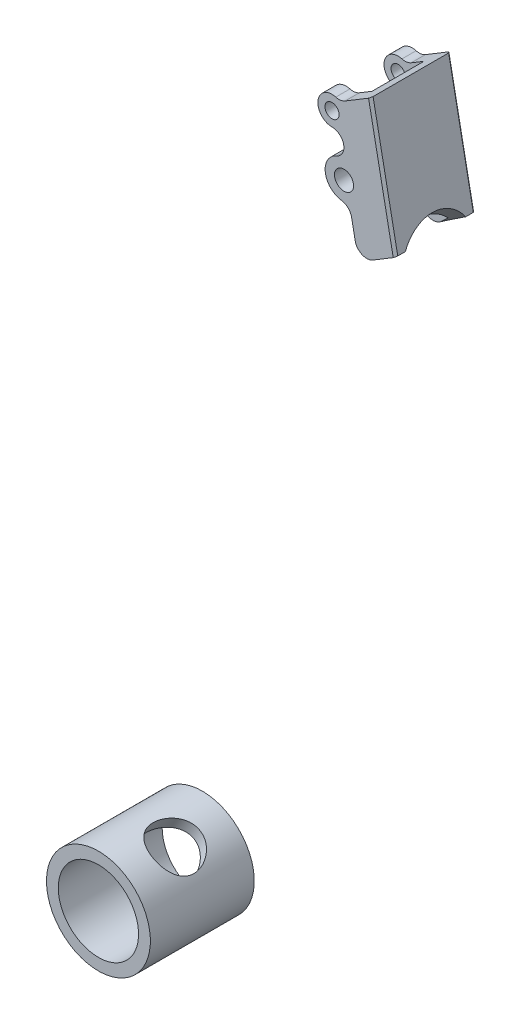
ISO-10303-21;
HEADER;
FILE_DESCRIPTION(('STEP AP214'),'2;1');
FILE_NAME('part.step','',(''),(''),'','','');
FILE_SCHEMA(('AUTOMOTIVE_DESIGN { 1 0 10303 214 1 1 1 1 }'));
ENDSEC;
DATA;
#1=APPLICATION_CONTEXT('core data for automotive mechanical design processes');
#2=APPLICATION_PROTOCOL_DEFINITION('international standard','automotive_design',2000,#1);
#3=PRODUCT_CONTEXT('',#1,'mechanical');
#4=PRODUCT('Part','Part','',(#3));
#5=PRODUCT_RELATED_PRODUCT_CATEGORY('part','',(#4));
#6=PRODUCT_DEFINITION_FORMATION('','',#4);
#7=PRODUCT_DEFINITION_CONTEXT('part definition',#1,'design');
#8=PRODUCT_DEFINITION('design','',#6,#7);
#9=PRODUCT_DEFINITION_SHAPE('','',#8);
#10=(LENGTH_UNIT() NAMED_UNIT(*) SI_UNIT(.MILLI.,.METRE.));
#11=(NAMED_UNIT(*) PLANE_ANGLE_UNIT() SI_UNIT($,.RADIAN.));
#12=(NAMED_UNIT(*) SI_UNIT($,.STERADIAN.) SOLID_ANGLE_UNIT());
#13=UNCERTAINTY_MEASURE_WITH_UNIT(LENGTH_MEASURE(1.E-05),#10,'distance_accuracy_value','');
#14=(GEOMETRIC_REPRESENTATION_CONTEXT(3) GLOBAL_UNCERTAINTY_ASSIGNED_CONTEXT((#13)) GLOBAL_UNIT_ASSIGNED_CONTEXT((#10,
#11,#12)) REPRESENTATION_CONTEXT('',''));
#15=CARTESIAN_POINT('',(0.,0.,0.));
#16=DIRECTION('',(0.,0.,1.));
#17=DIRECTION('',(1.,0.,0.));
#18=AXIS2_PLACEMENT_3D('',#15,#16,#17);
#19=CARTESIAN_POINT('',(120.881206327,296.714157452,16.048559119));
#20=DIRECTION('',(-0.693878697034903,-0.136133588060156,-0.707106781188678));
#21=DIRECTION('',(-0.71375145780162,0.,0.70039906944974));
#22=AXIS2_PLACEMENT_3D('',#19,#20,#21);
#23=PLANE('',#22);
#24=DIRECTION('',(-0.192521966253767,0.981292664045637,0.));
#25=VECTOR('',#24,1.);
#26=CARTESIAN_POINT('',(119.848287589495,297.037002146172,17.));
#27=LINE('',#26,#25);
#28=CARTESIAN_POINT('',(119.848287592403,297.037002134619,17.0000000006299));
#29=VERTEX_POINT('',#28);
#30=CARTESIAN_POINT('',(109.399530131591,350.294764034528,17.));
#31=VERTEX_POINT('',#30);
#32=EDGE_CURVE('P0_E125',#29,#31,#27,.T.);
#33=ORIENTED_EDGE('',*,*,#32,.F.);
#34=DIRECTION('',(-0.623995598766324,-0.376418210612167,0.684791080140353));
#35=VECTOR('',#34,1.);
#36=CARTESIAN_POINT('',(120.759507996,297.586685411,15.999999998));
#37=LINE('',#36,#35);
#38=CARTESIAN_POINT('',(120.759507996,297.586685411,15.999999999));
#39=VERTEX_POINT('',#38);
#40=EDGE_CURVE('P0_E166',#39,#29,#37,.T.);
#41=ORIENTED_EDGE('',*,*,#40,.F.);
#42=DIRECTION('',(0.192521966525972,-0.981292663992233,0.));
#43=VECTOR('',#42,1.);
#44=CARTESIAN_POINT('',(115.53512926,324.2155663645,16.));
#45=LINE('',#44,#43);
#46=CARTESIAN_POINT('',(110.310750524,350.844447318,15.9999999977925));
#47=VERTEX_POINT('',#46);
#48=EDGE_CURVE('P0_E126',#47,#39,#45,.T.);
#49=ORIENTED_EDGE('',*,*,#48,.F.);
#50=DIRECTION('',(0.623995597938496,0.376418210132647,-0.684791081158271));
#51=VECTOR('',#50,1.);
#52=CARTESIAN_POINT('',(109.399530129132,350.294764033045,16.9999999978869));
#53=LINE('',#52,#51);
#54=EDGE_CURVE('P0_E16',#31,#47,#53,.T.);
#55=ORIENTED_EDGE('',*,*,#54,.F.);
#56=EDGE_LOOP('',(#33,#41,#49,#55));
#57=FACE_BOUND('',#56,.T.);
#58=ADVANCED_FACE('P0_F12',(#57),#23,.F.);
#59=CARTESIAN_POINT('',(93.92,337.98,17.));
#60=DIRECTION('',(0.,0.,-1.));
#61=DIRECTION('',(-1.,0.,0.));
#62=AXIS2_PLACEMENT_3D('',#59,#60,#61);
#63=CYLINDRICAL_SURFACE('',#62,6.00000000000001);
#64=CARTESIAN_POINT('',(93.92,337.98,17.));
#65=DIRECTION('',(0.,0.,-1.));
#66=DIRECTION('',(-1.,0.,0.));
#67=AXIS2_PLACEMENT_3D('',#64,#65,#66);
#68=CIRCLE('',#67,6.00000000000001);
#69=CARTESIAN_POINT('',(95.5298850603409,343.759988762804,17.));
#70=VERTEX_POINT('',#69);
#71=CARTESIAN_POINT('',(93.9376623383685,331.980025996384,17.));
#72=VERTEX_POINT('',#71);
#73=EDGE_CURVE('P0_E348',#70,#72,#68,.F.);
#74=ORIENTED_EDGE('',*,*,#73,.F.);
#75=DIRECTION('',(0.,0.,-1.));
#76=VECTOR('',#75,1.);
#77=CARTESIAN_POINT('',(95.5298850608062,343.759988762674,14.));
#78=LINE('',#77,#76);
#79=CARTESIAN_POINT('',(95.5298850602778,343.759988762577,11.));
#80=VERTEX_POINT('',#79);
#81=EDGE_CURVE('P0_E177',#80,#70,#78,.F.);
#82=ORIENTED_EDGE('',*,*,#81,.F.);
#83=CARTESIAN_POINT('',(93.92,337.98,11.));
#84=DIRECTION('',(0.,0.,-1.));
#85=DIRECTION('',(-1.,0.,0.));
#86=AXIS2_PLACEMENT_3D('',#83,#84,#85);
#87=CIRCLE('',#86,6.00000000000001);
#88=CARTESIAN_POINT('',(93.937662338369,331.980025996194,11.));
#89=VERTEX_POINT('',#88);
#90=EDGE_CURVE('P0_E360',#89,#80,#87,.T.);
#91=ORIENTED_EDGE('',*,*,#90,.F.);
#92=DIRECTION('',(0.,0.,1.));
#93=VECTOR('',#92,1.);
#94=CARTESIAN_POINT('',(93.937662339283,331.980025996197,14.));
#95=LINE('',#94,#93);
#96=EDGE_CURVE('P0_E129',#72,#89,#95,.F.);
#97=ORIENTED_EDGE('',*,*,#96,.F.);
#98=EDGE_LOOP('',(#74,#82,#91,#97));
#99=FACE_BOUND('',#98,.T.);
#100=ADVANCED_FACE('P0_F431',(#99),#63,.T.);
#101=CARTESIAN_POINT('',(93.952380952,326.98004766,17.));
#102=DIRECTION('',(0.,0.,-1.));
#103=DIRECTION('',(-1.,0.,0.));
#104=AXIS2_PLACEMENT_3D('',#101,#102,#103);
#105=CYLINDRICAL_SURFACE('',#104,4.99999999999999);
#106=CARTESIAN_POINT('',(93.952380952,326.98004766,17.));
#107=DIRECTION('',(0.,0.,-1.));
#108=DIRECTION('',(-1.,0.,0.));
#109=AXIS2_PLACEMENT_3D('',#106,#107,#108);
#110=CIRCLE('',#109,4.99999999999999);
#111=CARTESIAN_POINT('',(95.8937728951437,322.372337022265,17.));
#112=VERTEX_POINT('',#111);
#113=EDGE_CURVE('P0_E345',#72,#112,#110,.T.);
#114=ORIENTED_EDGE('',*,*,#113,.F.);
#115=ORIENTED_EDGE('',*,*,#96,.T.);
#116=CARTESIAN_POINT('',(93.952380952,326.98004766,11.));
#117=DIRECTION('',(0.,0.,-1.));
#118=DIRECTION('',(-1.,0.,0.));
#119=AXIS2_PLACEMENT_3D('',#116,#117,#118);
#120=CIRCLE('',#119,4.99999999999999);
#121=CARTESIAN_POINT('',(95.8937728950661,322.372337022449,11.));
#122=VERTEX_POINT('',#121);
#123=EDGE_CURVE('P0_E362',#122,#89,#120,.F.);
#124=ORIENTED_EDGE('',*,*,#123,.F.);
#125=DIRECTION('',(0.,0.,-1.));
#126=VECTOR('',#125,1.);
#127=CARTESIAN_POINT('',(95.8937728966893,322.372337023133,14.));
#128=LINE('',#127,#126);
#129=EDGE_CURVE('P0_E172',#122,#112,#128,.F.);
#130=ORIENTED_EDGE('',*,*,#129,.T.);
#131=EDGE_LOOP('',(#114,#115,#124,#130));
#132=FACE_BOUND('',#131,.T.);
#133=ADVANCED_FACE('P0_F434',(#132),#105,.F.);
#134=CARTESIAN_POINT('',(99.,315.,17.));
#135=DIRECTION('',(0.,0.,-1.));
#136=DIRECTION('',(-1.,0.,0.));
#137=AXIS2_PLACEMENT_3D('',#134,#135,#136);
#138=CYLINDRICAL_SURFACE('',#137,8.00000000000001);
#139=CARTESIAN_POINT('',(99.,315.,17.));
#140=DIRECTION('',(0.,0.,-1.));
#141=DIRECTION('',(-1.,0.,0.));
#142=AXIS2_PLACEMENT_3D('',#139,#140,#141);
#143=CIRCLE('',#142,8.00000000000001);
#144=CARTESIAN_POINT('',(97.9406319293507,307.070451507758,17.));
#145=VERTEX_POINT('',#144);
#146=EDGE_CURVE('P0_E343',#112,#145,#143,.F.);
#147=ORIENTED_EDGE('',*,*,#146,.F.);
#148=ORIENTED_EDGE('',*,*,#129,.F.);
#149=CARTESIAN_POINT('',(99.,315.,11.));
#150=DIRECTION('',(0.,0.,-1.));
#151=DIRECTION('',(-1.,0.,0.));
#152=AXIS2_PLACEMENT_3D('',#149,#150,#151);
#153=CIRCLE('',#152,8.00000000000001);
#154=CARTESIAN_POINT('',(97.9406319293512,307.070451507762,11.));
#155=VERTEX_POINT('',#154);
#156=EDGE_CURVE('P0_E365',#155,#122,#153,.T.);
#157=ORIENTED_EDGE('',*,*,#156,.F.);
#158=DIRECTION('',(0.,0.,1.));
#159=VECTOR('',#158,1.);
#160=CARTESIAN_POINT('',(97.9406319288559,307.070451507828,14.));
#161=LINE('',#160,#159);
#162=EDGE_CURVE('P0_E169',#145,#155,#161,.F.);
#163=ORIENTED_EDGE('',*,*,#162,.F.);
#164=EDGE_LOOP('',(#147,#148,#157,#163));
#165=FACE_BOUND('',#164,.T.);
#166=ADVANCED_FACE('P0_F436',(#165),#138,.T.);
#167=CARTESIAN_POINT('',(97.278526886,302.1144837,17.));
#168=DIRECTION('',(0.,0.,-1.));
#169=DIRECTION('',(-1.,0.,0.));
#170=AXIS2_PLACEMENT_3D('',#167,#168,#169);
#171=CYLINDRICAL_SURFACE('',#170,5.);
#172=DIRECTION('',(0.,0.,-1.));
#173=VECTOR('',#172,1.);
#174=CARTESIAN_POINT('',(102.184990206,303.077093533,14.));
#175=LINE('',#174,#173);
#176=CARTESIAN_POINT('',(102.184990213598,303.077093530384,17.));
#177=VERTEX_POINT('',#176);
#178=CARTESIAN_POINT('',(102.18499019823,303.077093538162,11.));
#179=VERTEX_POINT('',#178);
#180=EDGE_CURVE('P0_E167',#177,#179,#175,.T.);
#181=ORIENTED_EDGE('',*,*,#180,.F.);
#182=CARTESIAN_POINT('',(97.278526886,302.1144837,17.));
#183=DIRECTION('',(0.,0.,-1.));
#184=DIRECTION('',(-1.,0.,0.));
#185=AXIS2_PLACEMENT_3D('',#182,#183,#184);
#186=CIRCLE('',#185,5.);
#187=EDGE_CURVE('P0_E341',#145,#177,#186,.T.);
#188=ORIENTED_EDGE('',*,*,#187,.F.);
#189=ORIENTED_EDGE('',*,*,#162,.T.);
#190=CARTESIAN_POINT('',(97.278526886,302.1144837,11.));
#191=DIRECTION('',(0.,0.,-1.));
#192=DIRECTION('',(-1.,0.,0.));
#193=AXIS2_PLACEMENT_3D('',#190,#191,#192);
#194=CIRCLE('',#193,5.);
#195=EDGE_CURVE('P0_E368',#179,#155,#194,.F.);
#196=ORIENTED_EDGE('',*,*,#195,.F.);
#197=EDGE_LOOP('',(#181,#188,#189,#196));
#198=FACE_BOUND('',#197,.T.);
#199=ADVANCED_FACE('P0_F442',(#198),#171,.F.);
#200=CARTESIAN_POINT('',(102.184990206,303.077093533,11.));
#201=DIRECTION('',(-0.981292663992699,-0.192521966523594,0.));
#202=DIRECTION('',(0.192521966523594,-0.981292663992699,0.));
#203=AXIS2_PLACEMENT_3D('',#200,#201,#202);
#204=PLANE('',#203);
#205=DIRECTION('',(0.,0.,-1.));
#206=VECTOR('',#205,1.);
#207=CARTESIAN_POINT('',(103.739091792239,295.155771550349,14.));
#208=LINE('',#207,#206);
#209=CARTESIAN_POINT('',(103.739091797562,295.155771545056,11.));
#210=VERTEX_POINT('',#209);
#211=CARTESIAN_POINT('',(103.739091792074,295.155771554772,17.));
#212=VERTEX_POINT('',#211);
#213=EDGE_CURVE('P0_E163',#210,#212,#208,.F.);
#214=ORIENTED_EDGE('',*,*,#213,.T.);
#215=DIRECTION('',(0.192521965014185,-0.981292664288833,0.));
#216=VECTOR('',#215,1.);
#217=CARTESIAN_POINT('',(102.184990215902,303.077093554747,17.));
#218=LINE('',#217,#216);
#219=EDGE_CURVE('P0_E339',#177,#212,#218,.T.);
#220=ORIENTED_EDGE('',*,*,#219,.F.);
#221=ORIENTED_EDGE('',*,*,#180,.T.);
#222=DIRECTION('',(-0.192521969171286,0.981292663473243,0.));
#223=VECTOR('',#222,1.);
#224=CARTESIAN_POINT('',(103.739091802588,295.155771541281,11.));
#225=LINE('',#224,#223);
#226=EDGE_CURVE('P0_E371',#210,#179,#225,.T.);
#227=ORIENTED_EDGE('',*,*,#226,.F.);
#228=EDGE_LOOP('',(#214,#220,#221,#227));
#229=FACE_BOUND('',#228,.T.);
#230=ADVANCED_FACE('P0_F447',(#229),#204,.T.);
#231=CARTESIAN_POINT('',(108.645555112,296.118381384,17.));
#232=DIRECTION('',(0.,0.,-1.));
#233=DIRECTION('',(-1.,0.,0.));
#234=AXIS2_PLACEMENT_3D('',#231,#232,#233);
#235=CYLINDRICAL_SURFACE('',#234,5.);
#236=DIRECTION('',(0.,0.,-1.));
#237=VECTOR('',#236,1.);
#238=CARTESIAN_POINT('',(111.228221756,291.837045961,14.));
#239=LINE('',#238,#237);
#240=CARTESIAN_POINT('',(111.228221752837,291.837045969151,17.));
#241=VERTEX_POINT('',#240);
#242=CARTESIAN_POINT('',(111.228221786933,291.837045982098,11.));
#243=VERTEX_POINT('',#242);
#244=EDGE_CURVE('P0_E162',#241,#243,#239,.T.);
#245=ORIENTED_EDGE('',*,*,#244,.F.);
#246=CARTESIAN_POINT('',(108.645555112,296.118381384,17.));
#247=DIRECTION('',(0.,0.,-1.));
#248=DIRECTION('',(-1.,0.,0.));
#249=AXIS2_PLACEMENT_3D('',#246,#247,#248);
#250=CIRCLE('',#249,5.);
#251=EDGE_CURVE('P0_E337',#212,#241,#250,.F.);
#252=ORIENTED_EDGE('',*,*,#251,.F.);
#253=ORIENTED_EDGE('',*,*,#213,.F.);
#254=CARTESIAN_POINT('',(108.645555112,296.118381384,11.));
#255=DIRECTION('',(0.,0.,-1.));
#256=DIRECTION('',(-1.,0.,0.));
#257=AXIS2_PLACEMENT_3D('',#254,#255,#256);
#258=CIRCLE('',#257,5.);
#259=EDGE_CURVE('P0_E374',#243,#210,#258,.T.);
#260=ORIENTED_EDGE('',*,*,#259,.F.);
#261=EDGE_LOOP('',(#245,#252,#253,#260));
#262=FACE_BOUND('',#261,.T.);
#263=ADVANCED_FACE('P0_F450',(#262),#235,.T.);
#264=CARTESIAN_POINT('',(99.,315.,17.));
#265=DIRECTION('',(0.,0.,-1.));
#266=DIRECTION('',(-1.,0.,0.));
#267=AXIS2_PLACEMENT_3D('',#264,#265,#266);
#268=CYLINDRICAL_SURFACE('',#267,4.05);
#269=CARTESIAN_POINT('',(99.,315.,17.));
#270=DIRECTION('',(0.,0.,-1.));
#271=DIRECTION('',(-1.,0.,0.));
#272=AXIS2_PLACEMENT_3D('',#269,#270,#271);
#273=CIRCLE('',#272,4.05);
#274=CARTESIAN_POINT('',(94.95,315.,17.));
#275=VERTEX_POINT('',#274);
#276=EDGE_CURVE('P0_E334',#275,#275,#273,.T.);
#277=ORIENTED_EDGE('',*,*,#276,.F.);
#278=EDGE_LOOP('',(#277));
#279=FACE_BOUND('',#278,.T.);
#280=CARTESIAN_POINT('',(99.,315.,11.));
#281=DIRECTION('',(0.,0.,-1.));
#282=DIRECTION('',(-1.,0.,0.));
#283=AXIS2_PLACEMENT_3D('',#280,#281,#282);
#284=CIRCLE('',#283,4.05);
#285=CARTESIAN_POINT('',(94.95,315.,11.));
#286=VERTEX_POINT('',#285);
#287=EDGE_CURVE('P0_E357',#286,#286,#284,.F.);
#288=ORIENTED_EDGE('',*,*,#287,.F.);
#289=EDGE_LOOP('',(#288));
#290=FACE_BOUND('',#289,.T.);
#291=ADVANCED_FACE('P0_F547',(#279,#290),#268,.F.);
#292=CARTESIAN_POINT('',(93.92,337.98,17.));
#293=DIRECTION('',(0.,0.,-1.));
#294=DIRECTION('',(-1.,0.,0.));
#295=AXIS2_PLACEMENT_3D('',#292,#293,#294);
#296=CYLINDRICAL_SURFACE('',#295,3.);
#297=CARTESIAN_POINT('',(93.92,337.98,17.));
#298=DIRECTION('',(0.,0.,-1.));
#299=DIRECTION('',(-1.,0.,0.));
#300=AXIS2_PLACEMENT_3D('',#297,#298,#299);
#301=CIRCLE('',#300,3.);
#302=CARTESIAN_POINT('',(90.92,337.98,17.));
#303=VERTEX_POINT('',#302);
#304=EDGE_CURVE('P0_E331',#303,#303,#301,.T.);
#305=ORIENTED_EDGE('',*,*,#304,.F.);
#306=EDGE_LOOP('',(#305));
#307=FACE_BOUND('',#306,.T.);
#308=CARTESIAN_POINT('',(93.92,337.98,11.));
#309=DIRECTION('',(0.,0.,-1.));
#310=DIRECTION('',(-1.,0.,0.));
#311=AXIS2_PLACEMENT_3D('',#308,#309,#310);
#312=CIRCLE('',#311,3.);
#313=CARTESIAN_POINT('',(90.92,337.98,11.));
#314=VERTEX_POINT('',#313);
#315=EDGE_CURVE('P0_E354',#314,#314,#312,.F.);
#316=ORIENTED_EDGE('',*,*,#315,.F.);
#317=EDGE_LOOP('',(#316));
#318=FACE_BOUND('',#317,.T.);
#319=ADVANCED_FACE('P0_F529',(#307,#318),#296,.F.);
#320=CARTESIAN_POINT('',(111.228221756,291.837045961,11.));
#321=DIRECTION('',(0.516533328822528,-0.85626708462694,0.));
#322=DIRECTION('',(0.85626708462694,0.516533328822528,0.));
#323=AXIS2_PLACEMENT_3D('',#320,#321,#322);
#324=PLANE('',#323);
#325=ORIENTED_EDGE('',*,*,#244,.T.);
#326=DIRECTION('',(-0.856267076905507,-0.516533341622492,0.));
#327=VECTOR('',#326,1.);
#328=CARTESIAN_POINT('',(111.822758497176,292.195693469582,11.));
#329=LINE('',#328,#327);
#330=CARTESIAN_POINT('',(111.822758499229,292.195693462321,11.0000000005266));
#331=VERTEX_POINT('',#330);
#332=EDGE_CURVE('P0_E377',#331,#243,#329,.T.);
#333=ORIENTED_EDGE('',*,*,#332,.F.);
#334=CARTESIAN_POINT('',(111.822758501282,292.195693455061,11.0000000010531));
#335=CARTESIAN_POINT('',(112.191715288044,292.418262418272,11.0941798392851));
#336=CARTESIAN_POINT('',(112.561216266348,292.64115965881,11.1854095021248));
#337=CARTESIAN_POINT('',(113.301169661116,293.087528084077,11.3623885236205));
#338=CARTESIAN_POINT('',(113.671622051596,293.310999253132,11.4481380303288));
#339=CARTESIAN_POINT('',(114.783917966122,293.981979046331,11.6977335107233));
#340=CARTESIAN_POINT('',(115.527011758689,294.430241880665,11.8540051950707));
#341=CARTESIAN_POINT('',(117.017070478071,295.329102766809,12.1493360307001));
#342=CARTESIAN_POINT('',(117.764039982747,295.77970358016,12.2883634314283));
#343=CARTESIAN_POINT('',(118.886120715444,296.456585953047,12.4854254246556));
#344=CARTESIAN_POINT('',(119.260499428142,296.68242563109,12.5492120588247));
#345=CARTESIAN_POINT('',(120.009690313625,297.134366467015,12.6731782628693));
#346=CARTESIAN_POINT('',(120.384502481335,297.360467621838,12.7333578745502));
#347=CARTESIAN_POINT('',(120.759507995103,297.586685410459,12.7918507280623));
#348=B_SPLINE_CURVE_WITH_KNOTS('',3,(#334,#335,#336,#337,#338,#339,#340,#341,#342,#343,#344,
#345,#346,#347),.UNSPECIFIED.,.F.,.F.,(4,2,2,2,2,2,4),(0.,1.32316165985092,2.64628755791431,
5.29142292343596,7.94135846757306,9.26689674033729,10.5924196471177),.UNSPECIFIED.);
#349=CARTESIAN_POINT('',(120.759507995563,297.586685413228,12.7918507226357));
#350=VERTEX_POINT('',#349);
#351=EDGE_CURVE('P0_E296',#331,#350,#348,.T.);
#352=ORIENTED_EDGE('',*,*,#351,.T.);
#353=DIRECTION('',(0.,0.,-1.));
#354=VECTOR('',#353,1.);
#355=CARTESIAN_POINT('',(120.759507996,297.586685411,0.));
#356=LINE('',#355,#354);
#357=EDGE_CURVE('P0_E161',#39,#350,#356,.T.);
#358=ORIENTED_EDGE('',*,*,#357,.F.);
#359=ORIENTED_EDGE('',*,*,#40,.T.);
#360=DIRECTION('',(0.856267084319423,0.516533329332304,0.));
#361=VECTOR('',#360,1.);
#362=CARTESIAN_POINT('',(111.228221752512,291.837045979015,17.));
#363=LINE('',#362,#361);
#364=EDGE_CURVE('P0_E138',#241,#29,#363,.T.);
#365=ORIENTED_EDGE('',*,*,#364,.F.);
#366=EDGE_LOOP('',(#325,#333,#352,#358,#359,#365));
#367=FACE_BOUND('',#366,.T.);
#368=ADVANCED_FACE('P0_F381',(#367),#324,.T.);
#369=CARTESIAN_POINT('',(120.759507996,297.586685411,-16.));
#370=DIRECTION('',(0.981292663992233,0.192521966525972,0.));
#371=DIRECTION('',(-0.192521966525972,0.981292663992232,0.));
#372=AXIS2_PLACEMENT_3D('',#369,#370,#371);
#373=PLANE('',#372);
#374=ORIENTED_EDGE('',*,*,#48,.T.);
#375=ORIENTED_EDGE('',*,*,#357,.T.);
#376=CARTESIAN_POINT('',(120.759507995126,297.586685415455,12.7918507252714));
#377=CARTESIAN_POINT('',(120.709369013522,297.842245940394,12.6237473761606));
#378=CARTESIAN_POINT('',(120.660056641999,298.093593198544,12.4489578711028));
#379=CARTESIAN_POINT('',(120.563227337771,298.587136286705,12.0861316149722));
#380=CARTESIAN_POINT('',(120.515711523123,298.829326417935,11.8980868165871));
#381=CARTESIAN_POINT('',(120.422671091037,299.303557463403,11.50904683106));
#382=CARTESIAN_POINT('',(120.37714683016,299.53559656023,11.3080493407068));
#383=CARTESIAN_POINT('',(120.288065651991,299.989647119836,10.8924631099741));
#384=CARTESIAN_POINT('',(120.244519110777,300.211605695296,10.6778143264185));
#385=CARTESIAN_POINT('',(120.159815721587,300.643342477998,10.2362065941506));
#386=CARTESIAN_POINT('',(120.118658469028,300.853122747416,10.0092497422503));
#387=CARTESIAN_POINT('',(120.038916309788,301.259571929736,9.54349058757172));
#388=CARTESIAN_POINT('',(120.000331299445,301.456241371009,9.30468876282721));
#389=CARTESIAN_POINT('',(119.907094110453,301.931475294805,8.692082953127));
#390=CARTESIAN_POINT('',(119.854181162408,302.201174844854,8.3110636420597));
#391=CARTESIAN_POINT('',(119.755232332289,302.705521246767,7.52561874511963));
#392=CARTESIAN_POINT('',(119.709196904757,302.940165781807,7.12119161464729));
#393=CARTESIAN_POINT('',(119.624693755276,303.370881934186,6.29266123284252));
#394=CARTESIAN_POINT('',(119.586209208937,303.567039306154,5.86860438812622));
#395=CARTESIAN_POINT('',(119.517223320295,303.918663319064,5.00332989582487));
#396=CARTESIAN_POINT('',(119.4867210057,304.07413491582,4.56211434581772));
#397=CARTESIAN_POINT('',(119.436559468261,304.329810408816,3.70737696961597));
#398=CARTESIAN_POINT('',(119.416163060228,304.43377176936,3.295019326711));
#399=CARTESIAN_POINT('',(119.382593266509,304.604878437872,2.46244452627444));
#400=CARTESIAN_POINT('',(119.369419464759,304.672025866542,2.04222782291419));
#401=CARTESIAN_POINT('',(119.35046917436,304.768616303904,1.19721456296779));
#402=CARTESIAN_POINT('',(119.344694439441,304.798050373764,0.772416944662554));
#403=CARTESIAN_POINT('',(119.340627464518,304.818779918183,-0.0781384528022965));
#404=CARTESIAN_POINT('',(119.342334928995,304.810076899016,-0.503896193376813));
#405=CARTESIAN_POINT('',(119.352833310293,304.756566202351,-1.32364859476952));
#406=CARTESIAN_POINT('',(119.361129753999,304.714278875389,-1.71781673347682));
#407=CARTESIAN_POINT('',(119.384091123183,304.597243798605,-2.50109360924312));
#408=CARTESIAN_POINT('',(119.39875568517,304.522497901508,-2.89020263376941));
#409=CARTESIAN_POINT('',(119.434274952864,304.341454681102,-3.66049604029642));
#410=CARTESIAN_POINT('',(119.455126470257,304.235173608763,-4.04168439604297));
#411=CARTESIAN_POINT('',(119.502790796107,303.992226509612,-4.79386221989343));
#412=CARTESIAN_POINT('',(119.529603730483,303.855559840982,-5.16485147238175));
#413=CARTESIAN_POINT('',(119.589197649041,303.551807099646,-5.89794449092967));
#414=CARTESIAN_POINT('',(119.622034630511,303.384435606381,-6.25992529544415));
#415=CARTESIAN_POINT('',(119.693162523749,303.021893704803,-6.96911191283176));
#416=CARTESIAN_POINT('',(119.731453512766,302.826722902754,-7.31631751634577));
#417=CARTESIAN_POINT('',(119.81317188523,302.410200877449,-7.99456515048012));
#418=CARTESIAN_POINT('',(119.856605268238,302.188819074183,-8.32558765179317));
#419=CARTESIAN_POINT('',(119.948189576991,301.72200995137,-8.96953866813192));
#420=CARTESIAN_POINT('',(119.996340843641,301.47658089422,-9.28246587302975));
#421=CARTESIAN_POINT('',(120.09820180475,300.957391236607,-9.89641183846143));
#422=CARTESIAN_POINT('',(120.152019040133,300.683082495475,-10.1969487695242));
#423=CARTESIAN_POINT('',(120.263772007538,300.113472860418,-10.7766491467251));
#424=CARTESIAN_POINT('',(120.321708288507,299.818169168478,-11.055809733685));
#425=CARTESIAN_POINT('',(120.441101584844,299.209616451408,-11.591088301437));
#426=CARTESIAN_POINT('',(120.502547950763,298.896421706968,-11.8472704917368));
#427=CARTESIAN_POINT('',(120.62868789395,298.253481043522,-12.3367984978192));
#428=CARTESIAN_POINT('',(120.693380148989,297.923741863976,-12.570153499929));
#429=CARTESIAN_POINT('',(120.759507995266,297.58668541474,-12.791850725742));
#430=B_SPLINE_CURVE_WITH_KNOTS('',3,(#376,#377,#378,#379,#380,#381,#382,#383,#384,#385,#386,
#387,#388,#389,#390,#391,#392,#393,#394,#395,#396,#397,#398,#399,#400,#401,#402,#403,#404,#405,
#406,#407,#408,#409,#410,#411,#412,#413,#414,#415,#416,#417,#418,#419,#420,#421,#422,#423,#424,
#425,#426,#427,#428,#429),.UNSPECIFIED.,.F.,.F.,(4,2,2,2,2,2,2,2,2,2,2,2,2,2,2,2,2,2,2,2,2,2,2,
2,2,2,4),(0.,0.929847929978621,1.86026531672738,2.79084860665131,3.72585374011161,
4.66070008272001,5.59550872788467,7.00292616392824,8.41043657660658,9.8147743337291,
11.2189409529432,12.4945154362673,13.7700164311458,15.0458196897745,16.3215725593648,
17.5097193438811,18.6977983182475,19.8852661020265,21.072758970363,22.2719079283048,
23.4710738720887,24.6716529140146,25.8723187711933,27.1024994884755,28.3328444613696,
29.5596367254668,30.7859332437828),.UNSPECIFIED.);
#431=CARTESIAN_POINT('',(120.759507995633,297.58668541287,-12.791850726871));
#432=VERTEX_POINT('',#431);
#433=EDGE_CURVE('P0_E325',#350,#432,#430,.T.);
#434=ORIENTED_EDGE('',*,*,#433,.T.);
#435=DIRECTION('',(0.,0.,1.));
#436=VECTOR('',#435,1.);
#437=CARTESIAN_POINT('',(120.759507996,297.586685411,-14.));
#438=LINE('',#437,#436);
#439=CARTESIAN_POINT('',(120.759507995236,297.586685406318,-16.0000000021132));
#440=VERTEX_POINT('',#439);
#441=EDGE_CURVE('P0_E287',#440,#432,#438,.T.);
#442=ORIENTED_EDGE('',*,*,#441,.F.);
#443=DIRECTION('',(0.192521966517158,-0.981292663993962,-1.28483104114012E-11));
#444=VECTOR('',#443,1.);
#445=CARTESIAN_POINT('',(110.310750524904,350.844447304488,-16.0000000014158));
#446=LINE('',#445,#444);
#447=CARTESIAN_POINT('',(110.31075052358,350.844447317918,-15.9999999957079));
#448=VERTEX_POINT('',#447);
#449=EDGE_CURVE('P0_E288',#448,#440,#446,.T.);
#450=ORIENTED_EDGE('',*,*,#449,.F.);
#451=DIRECTION('',(0.,0.,-1.));
#452=VECTOR('',#451,1.);
#453=CARTESIAN_POINT('',(110.310750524,350.844447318,0.));
#454=LINE('',#453,#452);
#455=EDGE_CURVE('P0_E157',#47,#448,#454,.T.);
#456=ORIENTED_EDGE('',*,*,#455,.F.);
#457=EDGE_LOOP('',(#374,#375,#434,#442,#450,#456));
#458=FACE_BOUND('',#457,.T.);
#459=ADVANCED_FACE('P0_F316',(#458),#373,.T.);
#460=CARTESIAN_POINT('',(115.271515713,290.779813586,11.));
#461=DIRECTION('',(0.,0.,-1.));
#462=DIRECTION('',(-1.,0.,0.));
#463=AXIS2_PLACEMENT_3D('',#460,#461,#462);
#464=PLANE('',#463);
#465=ORIENTED_EDGE('',*,*,#315,.T.);
#466=EDGE_LOOP('',(#465));
#467=FACE_BOUND('',#466,.T.);
#468=ORIENTED_EDGE('',*,*,#287,.T.);
#469=EDGE_LOOP('',(#468));
#470=FACE_BOUND('',#469,.T.);
#471=DIRECTION('',(-0.856267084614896,-0.516533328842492,0.));
#472=VECTOR('',#471,1.);
#473=CARTESIAN_POINT('',(104.8824365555,347.56987898,11.000000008));
#474=LINE('',#473,#472);
#475=CARTESIAN_POINT('',(104.843428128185,347.546347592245,11.0000000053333));
#476=VERTEX_POINT('',#475);
#477=CARTESIAN_POINT('',(99.4541225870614,344.295310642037,11.000000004));
#478=VERTEX_POINT('',#477);
#479=EDGE_CURVE('P0_E149',#476,#478,#474,.T.);
#480=ORIENTED_EDGE('',*,*,#479,.F.);
#481=DIRECTION('',(-0.192521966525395,0.981292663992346,0.));
#482=VECTOR('',#481,1.);
#483=CARTESIAN_POINT('',(110.0067016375,321.228922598,11.));
#484=LINE('',#483,#482);
#485=CARTESIAN_POINT('',(115.108385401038,295.225423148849,10.9999999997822));
#486=VERTEX_POINT('',#485);
#487=EDGE_CURVE('P0_E295',#486,#476,#484,.T.);
#488=ORIENTED_EDGE('',*,*,#487,.F.);
#489=CARTESIAN_POINT('',(115.108385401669,295.225423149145,11.));
#490=CARTESIAN_POINT('',(114.55762307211,294.723892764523,11.));
#491=CARTESIAN_POINT('',(114.008439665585,294.220650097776,11.));
#492=CARTESIAN_POINT('',(112.913230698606,293.210740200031,11.));
#493=CARTESIAN_POINT('',(112.367205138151,292.704072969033,11.));
#494=CARTESIAN_POINT('',(111.822758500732,292.19569345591,11.));
#495=B_SPLINE_CURVE_WITH_KNOTS('',3,(#489,#490,#491,#492,#493,#494),.UNSPECIFIED.,.F.,.F.,(4,2,
4),(0.,2.23465889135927,4.46931778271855),.UNSPECIFIED.);
#496=EDGE_CURVE('P0_E319',#486,#331,#495,.T.);
#497=ORIENTED_EDGE('',*,*,#496,.T.);
#498=ORIENTED_EDGE('',*,*,#332,.T.);
#499=ORIENTED_EDGE('',*,*,#259,.T.);
#500=ORIENTED_EDGE('',*,*,#226,.T.);
#501=ORIENTED_EDGE('',*,*,#195,.T.);
#502=ORIENTED_EDGE('',*,*,#156,.T.);
#503=ORIENTED_EDGE('',*,*,#123,.T.);
#504=ORIENTED_EDGE('',*,*,#90,.T.);
#505=CARTESIAN_POINT('',(96.871455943,348.576646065,11.));
#506=DIRECTION('',(0.,0.,-1.));
#507=DIRECTION('',(-1.,0.,0.));
#508=AXIS2_PLACEMENT_3D('',#505,#506,#507);
#509=CIRCLE('',#508,5.);
#510=EDGE_CURVE('P0_E180',#478,#80,#509,.T.);
#511=ORIENTED_EDGE('',*,*,#510,.F.);
#512=EDGE_LOOP('',(#480,#488,#497,#498,#499,#500,#501,#502,#503,#504,#511));
#513=FACE_BOUND('',#512,.T.);
#514=ADVANCED_FACE('P0_F312',(#467,#470,#513),#464,.T.);
#515=CARTESIAN_POINT('',(96.871455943,348.576646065,17.));
#516=DIRECTION('',(0.,0.,-1.));
#517=DIRECTION('',(-1.,0.,0.));
#518=AXIS2_PLACEMENT_3D('',#515,#516,#517);
#519=CYLINDRICAL_SURFACE('',#518,5.);
#520=CARTESIAN_POINT('',(96.871455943,348.576646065,17.));
#521=DIRECTION('',(0.,0.,-1.));
#522=DIRECTION('',(-1.,0.,0.));
#523=AXIS2_PLACEMENT_3D('',#520,#521,#522);
#524=CIRCLE('',#523,5.);
#525=CARTESIAN_POINT('',(99.4541225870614,344.295310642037,17.));
#526=VERTEX_POINT('',#525);
#527=EDGE_CURVE('P0_E139',#526,#70,#524,.T.);
#528=ORIENTED_EDGE('',*,*,#527,.F.);
#529=DIRECTION('',(0.,0.,1.));
#530=VECTOR('',#529,1.);
#531=CARTESIAN_POINT('',(99.454122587,344.295310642,0.));
#532=LINE('',#531,#530);
#533=EDGE_CURVE('P0_E143',#478,#526,#532,.T.);
#534=ORIENTED_EDGE('',*,*,#533,.F.);
#535=ORIENTED_EDGE('',*,*,#510,.T.);
#536=ORIENTED_EDGE('',*,*,#81,.T.);
#537=EDGE_LOOP('',(#528,#534,#535,#536));
#538=FACE_BOUND('',#537,.T.);
#539=ADVANCED_FACE('P0_F310',(#538),#519,.F.);
#540=CARTESIAN_POINT('',(87.728430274,290.763323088,17.));
#541=DIRECTION('',(0.,0.,1.));
#542=DIRECTION('',(1.,0.,0.));
#543=AXIS2_PLACEMENT_3D('',#540,#541,#542);
#544=PLANE('',#543);
#545=ORIENTED_EDGE('',*,*,#304,.T.);
#546=EDGE_LOOP('',(#545));
#547=FACE_BOUND('',#546,.T.);
#548=ORIENTED_EDGE('',*,*,#276,.T.);
#549=EDGE_LOOP('',(#548));
#550=FACE_BOUND('',#549,.T.);
#551=ORIENTED_EDGE('',*,*,#219,.T.);
#552=ORIENTED_EDGE('',*,*,#251,.T.);
#553=ORIENTED_EDGE('',*,*,#364,.T.);
#554=ORIENTED_EDGE('',*,*,#32,.T.);
#555=DIRECTION('',(0.856267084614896,0.516533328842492,0.));
#556=VECTOR('',#555,1.);
#557=CARTESIAN_POINT('',(104.8824365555,347.56987898,17.));
#558=LINE('',#557,#556);
#559=EDGE_CURVE('P0_E135',#526,#31,#558,.T.);
#560=ORIENTED_EDGE('',*,*,#559,.F.);
#561=ORIENTED_EDGE('',*,*,#527,.T.);
#562=ORIENTED_EDGE('',*,*,#73,.T.);
#563=ORIENTED_EDGE('',*,*,#113,.T.);
#564=ORIENTED_EDGE('',*,*,#146,.T.);
#565=ORIENTED_EDGE('',*,*,#187,.T.);
#566=EDGE_LOOP('',(#551,#552,#553,#554,#560,#561,#562,#563,#564,#565));
#567=FACE_BOUND('',#566,.T.);
#568=ADVANCED_FACE('P0_F133',(#547,#550,#567),#544,.T.);
#569=CARTESIAN_POINT('',(113.478883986,290.794341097,-12.896983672));
#570=CARTESIAN_POINT('',(117.077600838,294.149844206,-12.896983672));
#571=CARTESIAN_POINT('',(120.74525753,297.429853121,-12.896983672));
#572=CARTESIAN_POINT('',(124.480270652,300.632951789,-12.896983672));
#573=CARTESIAN_POINT('',(105.873989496,296.723034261,-5.944053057));
#574=CARTESIAN_POINT('',(109.554837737,300.183889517,-5.944053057));
#575=CARTESIAN_POINT('',(113.306796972,303.567521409,-5.944053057));
#576=CARTESIAN_POINT('',(117.128247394,306.872469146,-5.944053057));
#577=CARTESIAN_POINT('',(105.873989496,296.723034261,5.944053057));
#578=CARTESIAN_POINT('',(109.554837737,300.183889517,5.944053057));
#579=CARTESIAN_POINT('',(113.306796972,303.567521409,5.944053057));
#580=CARTESIAN_POINT('',(117.128247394,306.872469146,5.944053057));
#581=CARTESIAN_POINT('',(113.478883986,290.794341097,12.896983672));
#582=CARTESIAN_POINT('',(117.077600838,294.149844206,12.896983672));
#583=CARTESIAN_POINT('',(120.74525753,297.429853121,12.896983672));
#584=CARTESIAN_POINT('',(124.480270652,300.632951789,12.896983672));
#585=(BOUNDED_SURFACE() B_SPLINE_SURFACE(3,3,((#569,#570,#571,#572),(#573,#574,#575,#576),(#577,
#578,#579,#580),(#581,#582,#583,#584)),.UNSPECIFIED.,.F.,.F.,
.F.) B_SPLINE_SURFACE_WITH_KNOTS((4,4),(4,4),(0.,1.),(0.,1.),
.UNSPECIFIED.) GEOMETRIC_REPRESENTATION_ITEM() RATIONAL_B_SPLINE_SURFACE(((1.,0.99985609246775,
0.99985609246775,1.),(0.723242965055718,0.723138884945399,0.723138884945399,0.723242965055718),
(0.723242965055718,0.723138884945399,0.723138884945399,0.723242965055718),(1.,0.99985609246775,
0.99985609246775,1.))) REPRESENTATION_ITEM('') SURFACE());
#586=CARTESIAN_POINT('',(115.108385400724,295.225423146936,-11.0000000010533));
#587=CARTESIAN_POINT('',(115.066863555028,295.437061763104,-10.8051048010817));
#588=CARTESIAN_POINT('',(115.026297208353,295.643830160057,-10.6046902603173));
#589=CARTESIAN_POINT('',(114.947205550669,296.046963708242,-10.1930413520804));
#590=CARTESIAN_POINT('',(114.90868146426,296.243322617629,-9.9818006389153));
#591=CARTESIAN_POINT('',(114.833847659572,296.624753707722,-9.54891366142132));
#592=CARTESIAN_POINT('',(114.797538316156,296.809823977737,-9.32726564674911));
#593=CARTESIAN_POINT('',(114.72717095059,297.168489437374,-8.87321303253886));
#594=CARTESIAN_POINT('',(114.693121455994,297.342041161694,-8.64077275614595));
#595=CARTESIAN_POINT('',(114.627578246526,297.676117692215,-8.16641043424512));
#596=CARTESIAN_POINT('',(114.596084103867,297.836644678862,-7.92448998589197));
#597=CARTESIAN_POINT('',(114.535802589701,298.143902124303,-7.43174685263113));
#598=CARTESIAN_POINT('',(114.507015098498,298.290633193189,-7.1809245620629));
#599=CARTESIAN_POINT('',(114.438460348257,298.640059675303,-6.54209290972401));
#600=CARTESIAN_POINT('',(114.400495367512,298.833568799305,-6.14880553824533));
#601=CARTESIAN_POINT('',(114.331514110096,299.185169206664,-5.34610196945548));
#602=CARTESIAN_POINT('',(114.30049826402,299.343258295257,-4.93668477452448));
#603=CARTESIAN_POINT('',(114.245882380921,299.621637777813,-4.10552137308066));
#604=CARTESIAN_POINT('',(114.222268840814,299.741996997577,-3.68379916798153));
#605=CARTESIAN_POINT('',(114.182720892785,299.943574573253,-2.83076271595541));
#606=CARTESIAN_POINT('',(114.166785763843,300.024796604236,-2.39944937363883));
#607=CARTESIAN_POINT('',(114.143737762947,300.142273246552,-1.56392471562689));
#608=CARTESIAN_POINT('',(114.136047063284,300.181473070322,-1.16014117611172));
#609=CARTESIAN_POINT('',(114.127521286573,300.224929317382,-0.350632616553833));
#610=CARTESIAN_POINT('',(114.12668587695,300.229187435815,0.0550923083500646));
#611=CARTESIAN_POINT('',(114.131881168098,300.202706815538,0.865318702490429));
#612=CARTESIAN_POINT('',(114.137911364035,300.171970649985,1.26982025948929));
#613=CARTESIAN_POINT('',(114.156758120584,300.075907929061,2.07452684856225));
#614=CARTESIAN_POINT('',(114.169574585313,300.010581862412,2.47473194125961));
#615=CARTESIAN_POINT('',(114.201196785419,299.849402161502,3.25232544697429));
#616=CARTESIAN_POINT('',(114.219748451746,299.754843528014,3.62999379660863));
#617=CARTESIAN_POINT('',(114.262751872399,299.535653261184,4.3761376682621));
#618=CARTESIAN_POINT('',(114.287203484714,299.411022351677,4.74461341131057));
#619=CARTESIAN_POINT('',(114.34176701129,299.132909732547,5.47049065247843));
#620=CARTESIAN_POINT('',(114.371884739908,298.979398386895,5.8278803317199));
#621=CARTESIAN_POINT('',(114.437454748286,298.645185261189,6.52919291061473));
#622=CARTESIAN_POINT('',(114.472906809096,298.464484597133,6.87311636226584));
#623=CARTESIAN_POINT('',(114.537477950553,298.135362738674,7.44540843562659));
#624=CARTESIAN_POINT('',(114.565333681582,297.993380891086,7.67765675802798));
#625=CARTESIAN_POINT('',(114.62338103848,297.697511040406,8.13417498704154));
#626=CARTESIAN_POINT('',(114.653572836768,297.543622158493,8.35844430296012));
#627=CARTESIAN_POINT('',(114.716166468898,297.224579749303,8.798545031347));
#628=CARTESIAN_POINT('',(114.748568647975,297.059424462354,9.01437511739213));
#629=CARTESIAN_POINT('',(114.815374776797,296.718910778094,9.43668948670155));
#630=CARTESIAN_POINT('',(114.84977405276,296.543576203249,9.64319372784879));
#631=CARTESIAN_POINT('',(114.920506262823,296.183051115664,10.0469968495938));
#632=CARTESIAN_POINT('',(114.956838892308,295.997862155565,10.2442971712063));
#633=CARTESIAN_POINT('',(115.03129626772,295.618349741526,10.6293477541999));
#634=CARTESIAN_POINT('',(115.06942006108,295.424031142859,10.8171029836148));
#635=CARTESIAN_POINT('',(115.108385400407,295.225423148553,10.9999999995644));
#636=B_SPLINE_CURVE_WITH_KNOTS('',3,(#586,#587,#588,#589,#590,#591,#592,#593,#594,#595,#596,
#597,#598,#599,#600,#601,#602,#603,#604,#605,#606,#607,#608,#609,#610,#611,#612,#613,#614,#615,
#616,#617,#618,#619,#620,#621,#622,#623,#624,#625,#626,#627,#628,#629,#630,#631,#632,#633,#634,
#635),.UNSPECIFIED.,.F.,.F.,(4,2,2,2,2,2,2,2,2,2,2,2,2,2,2,2,2,2,2,2,2,2,2,2,4),(0.,
0.871994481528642,1.74450605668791,2.61716490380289,3.49294872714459,4.36858563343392,
5.24418379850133,6.56222654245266,7.8803509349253,9.19605665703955,10.5116388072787,
11.7273646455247,12.9430315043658,14.1586089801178,15.3741692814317,16.5421499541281,
17.7101025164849,18.8792601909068,20.0483698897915,20.8689037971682,21.6894983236,
22.5102213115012,23.3290954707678,24.1478409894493,24.9661559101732),.UNSPECIFIED.);
#637=CARTESIAN_POINT('',(115.108385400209,295.225423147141,-11.0000000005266));
#638=VERTEX_POINT('',#637);
#639=EDGE_CURVE('P0_E289',#638,#486,#636,.T.);
#640=CARTESIAN_POINT('',(111.822758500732,292.19569345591,-11.));
#641=CARTESIAN_POINT('',(112.367205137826,292.704072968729,-11.));
#642=CARTESIAN_POINT('',(112.913230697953,293.210740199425,-11.));
#643=CARTESIAN_POINT('',(114.008439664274,294.22065009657,-11.));
#644=CARTESIAN_POINT('',(114.557623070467,294.72389276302,-11.));
#645=CARTESIAN_POINT('',(115.108385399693,295.225423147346,-11.));
#646=B_SPLINE_CURVE_WITH_KNOTS('',3,(#640,#641,#642,#643,#644,#645),.UNSPECIFIED.,.F.,.F.,(4,2,
4),(0.,2.23465889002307,4.46931778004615),.UNSPECIFIED.);
#647=CARTESIAN_POINT('',(111.822758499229,292.195693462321,-11.0000000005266));
#648=VERTEX_POINT('',#647);
#649=EDGE_CURVE('P0_E145',#648,#638,#646,.T.);
#650=CARTESIAN_POINT('',(120.759507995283,297.586685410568,-12.7918507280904));
#651=CARTESIAN_POINT('',(120.385132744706,297.360847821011,-12.7334561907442));
#652=CARTESIAN_POINT('',(120.010950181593,297.135126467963,-12.6733805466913));
#653=CARTESIAN_POINT('',(119.263017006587,296.683944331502,-12.5496347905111));
#654=CARTESIAN_POINT('',(118.889266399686,296.458483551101,-12.4859646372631));
#655=CARTESIAN_POINT('',(117.769066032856,295.782735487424,-12.2892724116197));
#656=CARTESIAN_POINT('',(117.023346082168,295.332888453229,-12.1505188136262));
#657=CARTESIAN_POINT('',(115.533270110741,294.434017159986,-11.8553061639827));
#658=CARTESIAN_POINT('',(114.788917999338,293.984995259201,-11.6988199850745));
#659=CARTESIAN_POINT('',(113.674741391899,293.312880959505,-11.4488556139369));
#660=CARTESIAN_POINT('',(113.30366299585,293.089032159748,-11.3629752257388));
#661=CARTESIAN_POINT('',(112.562460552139,292.641910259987,-11.1857166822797));
#662=CARTESIAN_POINT('',(112.192336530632,292.418637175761,-11.0943383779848));
#663=CARTESIAN_POINT('',(111.822758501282,292.195693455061,-11.0000000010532));
#664=B_SPLINE_CURVE_WITH_KNOTS('',3,(#650,#651,#652,#653,#654,#655,#656,#657,#658,#659,#660,
#661,#662,#663),.UNSPECIFIED.,.F.,.F.,(4,2,2,2,2,2,4),(0.,1.32329517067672,2.64660548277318,
5.29208950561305,7.94167665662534,9.26703015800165,10.5924196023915),.UNSPECIFIED.);
#665=EDGE_CURVE('P0_E280',#432,#648,#664,.T.);
#666=ORIENTED_EDGE('',*,*,#496,.F.);
#667=ORIENTED_EDGE('',*,*,#639,.F.);
#668=ORIENTED_EDGE('',*,*,#649,.F.);
#669=ORIENTED_EDGE('',*,*,#665,.F.);
#670=ORIENTED_EDGE('',*,*,#433,.F.);
#671=ORIENTED_EDGE('',*,*,#351,.F.);
#672=EDGE_LOOP('',(#666,#667,#668,#669,#670,#671));
#673=FACE_BOUND('',#672,.T.);
#674=ADVANCED_FACE('P0_F253',(#673),#585,.F.);
#675=CARTESIAN_POINT('',(104.843428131,347.546347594,-11.));
#676=DIRECTION('',(-0.981292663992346,-0.192521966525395,0.));
#677=DIRECTION('',(0.192521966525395,-0.981292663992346,0.));
#678=AXIS2_PLACEMENT_3D('',#675,#676,#677);
#679=PLANE('',#678);
#680=DIRECTION('',(0.,0.,1.));
#681=VECTOR('',#680,1.);
#682=CARTESIAN_POINT('',(104.843428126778,347.546347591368,0.));
#683=LINE('',#682,#681);
#684=CARTESIAN_POINT('',(104.843428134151,347.546347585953,-11.));
#685=VERTEX_POINT('',#684);
#686=EDGE_CURVE('P0_E154',#685,#476,#683,.T.);
#687=ORIENTED_EDGE('',*,*,#686,.F.);
#688=DIRECTION('',(-0.192521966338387,0.981292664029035,0.));
#689=VECTOR('',#688,1.);
#690=CARTESIAN_POINT('',(115.108385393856,295.225423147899,-11.));
#691=LINE('',#690,#689);
#692=EDGE_CURVE('P0_E147',#638,#685,#691,.T.);
#693=ORIENTED_EDGE('',*,*,#692,.F.);
#694=ORIENTED_EDGE('',*,*,#639,.T.);
#695=ORIENTED_EDGE('',*,*,#487,.T.);
#696=EDGE_LOOP('',(#687,#693,#694,#695));
#697=FACE_BOUND('',#696,.T.);
#698=ADVANCED_FACE('P0_F302',(#697),#679,.T.);
#699=CARTESIAN_POINT('',(96.871455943,348.576646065,-11.));
#700=DIRECTION('',(0.,0.,-1.));
#701=DIRECTION('',(-1.,0.,0.));
#702=AXIS2_PLACEMENT_3D('',#699,#700,#701);
#703=CYLINDRICAL_SURFACE('',#702,5.);
#704=CARTESIAN_POINT('',(96.871455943,348.576646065,-17.));
#705=DIRECTION('',(0.,0.,-1.));
#706=DIRECTION('',(-1.,0.,0.));
#707=AXIS2_PLACEMENT_3D('',#704,#705,#706);
#708=CIRCLE('',#707,5.);
#709=CARTESIAN_POINT('',(99.4541225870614,344.295310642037,-17.));
#710=VERTEX_POINT('',#709);
#711=CARTESIAN_POINT('',(95.5298850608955,343.759988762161,-17.));
#712=VERTEX_POINT('',#711);
#713=EDGE_CURVE('P0_E213',#710,#712,#708,.T.);
#714=ORIENTED_EDGE('',*,*,#713,.T.);
#715=DIRECTION('',(0.,0.,-1.));
#716=VECTOR('',#715,1.);
#717=CARTESIAN_POINT('',(95.5298850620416,343.759988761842,-14.));
#718=LINE('',#717,#716);
#719=CARTESIAN_POINT('',(95.5298850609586,343.759988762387,-11.));
#720=VERTEX_POINT('',#719);
#721=EDGE_CURVE('P0_E390',#712,#720,#718,.F.);
#722=ORIENTED_EDGE('',*,*,#721,.T.);
#723=CARTESIAN_POINT('',(96.871455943,348.576646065,-11.));
#724=DIRECTION('',(0.,0.,-1.));
#725=DIRECTION('',(-1.,0.,0.));
#726=AXIS2_PLACEMENT_3D('',#723,#724,#725);
#727=CIRCLE('',#726,5.);
#728=CARTESIAN_POINT('',(99.45412259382,344.295310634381,-11.));
#729=VERTEX_POINT('',#728);
#730=EDGE_CURVE('P0_E240',#729,#720,#727,.T.);
#731=ORIENTED_EDGE('',*,*,#730,.F.);
#732=DIRECTION('',(0.,0.,1.));
#733=VECTOR('',#732,1.);
#734=CARTESIAN_POINT('',(99.454122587,344.295310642,0.));
#735=LINE('',#734,#733);
#736=EDGE_CURVE('P0_E395',#710,#729,#735,.T.);
#737=ORIENTED_EDGE('',*,*,#736,.F.);
#738=EDGE_LOOP('',(#714,#722,#731,#737));
#739=FACE_BOUND('',#738,.T.);
#740=ADVANCED_FACE('P0_F306',(#739),#703,.F.);
#741=CARTESIAN_POINT('',(93.92,337.98,-11.));
#742=DIRECTION('',(0.,0.,-1.));
#743=DIRECTION('',(-1.,0.,0.));
#744=AXIS2_PLACEMENT_3D('',#741,#742,#743);
#745=CYLINDRICAL_SURFACE('',#744,6.00000000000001);
#746=CARTESIAN_POINT('',(93.92,337.98,-11.));
#747=DIRECTION('',(0.,0.,-1.));
#748=DIRECTION('',(-1.,0.,0.));
#749=AXIS2_PLACEMENT_3D('',#746,#747,#748);
#750=CIRCLE('',#749,6.00000000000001);
#751=CARTESIAN_POINT('',(93.9376623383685,331.980025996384,-11.));
#752=VERTEX_POINT('',#751);
#753=EDGE_CURVE('P0_E237',#720,#752,#750,.F.);
#754=ORIENTED_EDGE('',*,*,#753,.F.);
#755=ORIENTED_EDGE('',*,*,#721,.F.);
#756=CARTESIAN_POINT('',(93.92,337.98,-17.));
#757=DIRECTION('',(0.,0.,-1.));
#758=DIRECTION('',(-1.,0.,0.));
#759=AXIS2_PLACEMENT_3D('',#756,#757,#758);
#760=CIRCLE('',#759,6.00000000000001);
#761=CARTESIAN_POINT('',(93.937662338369,331.980025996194,-17.));
#762=VERTEX_POINT('',#761);
#763=EDGE_CURVE('P0_E210',#712,#762,#760,.F.);
#764=ORIENTED_EDGE('',*,*,#763,.T.);
#765=DIRECTION('',(0.,0.,1.));
#766=VECTOR('',#765,1.);
#767=CARTESIAN_POINT('',(93.937662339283,331.980025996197,-14.));
#768=LINE('',#767,#766);
#769=EDGE_CURVE('P0_E411',#752,#762,#768,.F.);
#770=ORIENTED_EDGE('',*,*,#769,.F.);
#771=EDGE_LOOP('',(#754,#755,#764,#770));
#772=FACE_BOUND('',#771,.T.);
#773=ADVANCED_FACE('P0_F519',(#772),#745,.T.);
#774=CARTESIAN_POINT('',(93.952380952,326.98004766,-11.));
#775=DIRECTION('',(0.,0.,-1.));
#776=DIRECTION('',(-1.,0.,0.));
#777=AXIS2_PLACEMENT_3D('',#774,#775,#776);
#778=CYLINDRICAL_SURFACE('',#777,4.99999999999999);
#779=CARTESIAN_POINT('',(93.952380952,326.98004766,-17.));
#780=DIRECTION('',(0.,0.,-1.));
#781=DIRECTION('',(-1.,0.,0.));
#782=AXIS2_PLACEMENT_3D('',#779,#780,#781);
#783=CIRCLE('',#782,4.99999999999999);
#784=CARTESIAN_POINT('',(95.8937728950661,322.372337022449,-17.));
#785=VERTEX_POINT('',#784);
#786=EDGE_CURVE('P0_E207',#762,#785,#783,.T.);
#787=ORIENTED_EDGE('',*,*,#786,.T.);
#788=DIRECTION('',(0.,0.,-1.));
#789=VECTOR('',#788,1.);
#790=CARTESIAN_POINT('',(95.8937728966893,322.372337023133,-14.));
#791=LINE('',#790,#789);
#792=CARTESIAN_POINT('',(95.8937728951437,322.372337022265,-11.));
#793=VERTEX_POINT('',#792);
#794=EDGE_CURVE('P0_E408',#785,#793,#791,.F.);
#795=ORIENTED_EDGE('',*,*,#794,.T.);
#796=CARTESIAN_POINT('',(93.952380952,326.98004766,-11.));
#797=DIRECTION('',(0.,0.,-1.));
#798=DIRECTION('',(-1.,0.,0.));
#799=AXIS2_PLACEMENT_3D('',#796,#797,#798);
#800=CIRCLE('',#799,4.99999999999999);
#801=EDGE_CURVE('P0_E234',#752,#793,#800,.T.);
#802=ORIENTED_EDGE('',*,*,#801,.F.);
#803=ORIENTED_EDGE('',*,*,#769,.T.);
#804=EDGE_LOOP('',(#787,#795,#802,#803));
#805=FACE_BOUND('',#804,.T.);
#806=ADVANCED_FACE('P0_F573',(#805),#778,.F.);
#807=CARTESIAN_POINT('',(99.,315.,-11.));
#808=DIRECTION('',(0.,0.,-1.));
#809=DIRECTION('',(-1.,0.,0.));
#810=AXIS2_PLACEMENT_3D('',#807,#808,#809);
#811=CYLINDRICAL_SURFACE('',#810,8.00000000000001);
#812=CARTESIAN_POINT('',(99.,315.,-11.));
#813=DIRECTION('',(0.,0.,-1.));
#814=DIRECTION('',(-1.,0.,0.));
#815=AXIS2_PLACEMENT_3D('',#812,#813,#814);
#816=CIRCLE('',#815,8.00000000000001);
#817=CARTESIAN_POINT('',(97.9406319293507,307.070451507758,-11.));
#818=VERTEX_POINT('',#817);
#819=EDGE_CURVE('P0_E231',#793,#818,#816,.F.);
#820=ORIENTED_EDGE('',*,*,#819,.F.);
#821=ORIENTED_EDGE('',*,*,#794,.F.);
#822=CARTESIAN_POINT('',(99.,315.,-17.));
#823=DIRECTION('',(0.,0.,-1.));
#824=DIRECTION('',(-1.,0.,0.));
#825=AXIS2_PLACEMENT_3D('',#822,#823,#824);
#826=CIRCLE('',#825,8.00000000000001);
#827=CARTESIAN_POINT('',(97.9406319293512,307.070451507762,-17.));
#828=VERTEX_POINT('',#827);
#829=EDGE_CURVE('P0_E204',#785,#828,#826,.F.);
#830=ORIENTED_EDGE('',*,*,#829,.T.);
#831=DIRECTION('',(0.,0.,1.));
#832=VECTOR('',#831,1.);
#833=CARTESIAN_POINT('',(97.9406319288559,307.070451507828,-14.));
#834=LINE('',#833,#832);
#835=EDGE_CURVE('P0_E405',#818,#828,#834,.F.);
#836=ORIENTED_EDGE('',*,*,#835,.F.);
#837=EDGE_LOOP('',(#820,#821,#830,#836));
#838=FACE_BOUND('',#837,.T.);
#839=ADVANCED_FACE('P0_F512',(#838),#811,.T.);
#840=CARTESIAN_POINT('',(97.278526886,302.1144837,-11.));
#841=DIRECTION('',(0.,0.,-1.));
#842=DIRECTION('',(-1.,0.,0.));
#843=AXIS2_PLACEMENT_3D('',#840,#841,#842);
#844=CYLINDRICAL_SURFACE('',#843,5.);
#845=ORIENTED_EDGE('',*,*,#835,.T.);
#846=CARTESIAN_POINT('',(97.278526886,302.1144837,-17.));
#847=DIRECTION('',(0.,0.,-1.));
#848=DIRECTION('',(-1.,0.,0.));
#849=AXIS2_PLACEMENT_3D('',#846,#847,#848);
#850=CIRCLE('',#849,5.);
#851=CARTESIAN_POINT('',(102.184990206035,303.07709353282,-17.));
#852=VERTEX_POINT('',#851);
#853=EDGE_CURVE('P0_E201',#828,#852,#850,.T.);
#854=ORIENTED_EDGE('',*,*,#853,.T.);
#855=DIRECTION('',(0.,0.,-1.));
#856=VECTOR('',#855,1.);
#857=CARTESIAN_POINT('',(102.184990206,303.077093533,-14.));
#858=LINE('',#857,#856);
#859=CARTESIAN_POINT('',(102.18499019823,303.077093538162,-11.));
#860=VERTEX_POINT('',#859);
#861=EDGE_CURVE('P0_E402',#860,#852,#858,.T.);
#862=ORIENTED_EDGE('',*,*,#861,.F.);
#863=CARTESIAN_POINT('',(97.278526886,302.1144837,-11.));
#864=DIRECTION('',(0.,0.,-1.));
#865=DIRECTION('',(-1.,0.,0.));
#866=AXIS2_PLACEMENT_3D('',#863,#864,#865);
#867=CIRCLE('',#866,5.);
#868=EDGE_CURVE('P0_E228',#818,#860,#867,.T.);
#869=ORIENTED_EDGE('',*,*,#868,.F.);
#870=EDGE_LOOP('',(#845,#854,#862,#869));
#871=FACE_BOUND('',#870,.T.);
#872=ADVANCED_FACE('P0_F508',(#871),#844,.F.);
#873=CARTESIAN_POINT('',(102.184990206,303.077093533,-17.));
#874=DIRECTION('',(-0.981292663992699,-0.192521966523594,0.));
#875=DIRECTION('',(0.192521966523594,-0.981292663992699,0.));
#876=AXIS2_PLACEMENT_3D('',#873,#874,#875);
#877=PLANE('',#876);
#878=ORIENTED_EDGE('',*,*,#861,.T.);
#879=DIRECTION('',(0.192521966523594,-0.981292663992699,0.));
#880=VECTOR('',#879,1.);
#881=CARTESIAN_POINT('',(102.184990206,303.077093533,-17.));
#882=LINE('',#881,#880);
#883=CARTESIAN_POINT('',(103.739091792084,295.155771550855,-17.));
#884=VERTEX_POINT('',#883);
#885=EDGE_CURVE('P0_E198',#852,#884,#882,.T.);
#886=ORIENTED_EDGE('',*,*,#885,.T.);
#887=DIRECTION('',(0.,0.,-1.));
#888=VECTOR('',#887,1.);
#889=CARTESIAN_POINT('',(103.739091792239,295.155771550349,-14.));
#890=LINE('',#889,#888);
#891=CARTESIAN_POINT('',(103.739091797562,295.155771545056,-11.));
#892=VERTEX_POINT('',#891);
#893=EDGE_CURVE('P0_E394',#884,#892,#890,.F.);
#894=ORIENTED_EDGE('',*,*,#893,.T.);
#895=DIRECTION('',(0.192521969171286,-0.981292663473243,0.));
#896=VECTOR('',#895,1.);
#897=CARTESIAN_POINT('',(102.184990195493,303.07709351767,-11.));
#898=LINE('',#897,#896);
#899=EDGE_CURVE('P0_E225',#860,#892,#898,.T.);
#900=ORIENTED_EDGE('',*,*,#899,.F.);
#901=EDGE_LOOP('',(#878,#886,#894,#900));
#902=FACE_BOUND('',#901,.T.);
#903=ADVANCED_FACE('P0_F277',(#902),#877,.T.);
#904=CARTESIAN_POINT('',(108.645555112,296.118381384,-11.));
#905=DIRECTION('',(0.,0.,-1.));
#906=DIRECTION('',(-1.,0.,0.));
#907=AXIS2_PLACEMENT_3D('',#904,#905,#906);
#908=CYLINDRICAL_SURFACE('',#907,5.);
#909=ORIENTED_EDGE('',*,*,#893,.F.);
#910=CARTESIAN_POINT('',(108.645555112,296.118381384,-17.));
#911=DIRECTION('',(0.,0.,-1.));
#912=DIRECTION('',(-1.,0.,0.));
#913=AXIS2_PLACEMENT_3D('',#910,#911,#912);
#914=CIRCLE('',#913,5.);
#915=CARTESIAN_POINT('',(111.228221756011,291.837045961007,-17.));
#916=VERTEX_POINT('',#915);
#917=EDGE_CURVE('P0_E195',#884,#916,#914,.F.);
#918=ORIENTED_EDGE('',*,*,#917,.T.);
#919=DIRECTION('',(0.,0.,-1.));
#920=VECTOR('',#919,1.);
#921=CARTESIAN_POINT('',(111.228221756,291.837045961,-14.));
#922=LINE('',#921,#920);
#923=CARTESIAN_POINT('',(111.228221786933,291.837045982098,-11.));
#924=VERTEX_POINT('',#923);
#925=EDGE_CURVE('P0_E286',#924,#916,#922,.T.);
#926=ORIENTED_EDGE('',*,*,#925,.F.);
#927=CARTESIAN_POINT('',(108.645555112,296.118381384,-11.));
#928=DIRECTION('',(0.,0.,-1.));
#929=DIRECTION('',(-1.,0.,0.));
#930=AXIS2_PLACEMENT_3D('',#927,#928,#929);
#931=CIRCLE('',#930,5.);
#932=EDGE_CURVE('P0_E222',#892,#924,#931,.F.);
#933=ORIENTED_EDGE('',*,*,#932,.F.);
#934=EDGE_LOOP('',(#909,#918,#926,#933));
#935=FACE_BOUND('',#934,.T.);
#936=ADVANCED_FACE('P0_F275',(#935),#908,.T.);
#937=CARTESIAN_POINT('',(111.228221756,291.837045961,-17.));
#938=DIRECTION('',(0.516533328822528,-0.85626708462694,0.));
#939=DIRECTION('',(0.85626708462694,0.516533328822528,0.));
#940=AXIS2_PLACEMENT_3D('',#937,#938,#939);
#941=PLANE('',#940);
#942=DIRECTION('',(0.85626708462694,0.516533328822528,0.));
#943=VECTOR('',#942,1.);
#944=CARTESIAN_POINT('',(111.228221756,291.837045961,-17.));
#945=LINE('',#944,#943);
#946=CARTESIAN_POINT('',(119.848287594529,297.037002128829,-17.0000000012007));
#947=VERTEX_POINT('',#946);
#948=EDGE_CURVE('P0_E192',#916,#947,#945,.T.);
#949=ORIENTED_EDGE('',*,*,#948,.T.);
#950=DIRECTION('',(-0.623995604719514,-0.376418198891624,-0.684791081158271));
#951=VECTOR('',#950,1.);
#952=CARTESIAN_POINT('',(120.759507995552,297.586685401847,-16.0000000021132));
#953=LINE('',#952,#951);
#954=EDGE_CURVE('P0_E159',#440,#947,#953,.T.);
#955=ORIENTED_EDGE('',*,*,#954,.F.);
#956=ORIENTED_EDGE('',*,*,#441,.T.);
#957=ORIENTED_EDGE('',*,*,#665,.T.);
#958=DIRECTION('',(0.856267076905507,0.516533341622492,0.));
#959=VECTOR('',#958,1.);
#960=CARTESIAN_POINT('',(111.228221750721,291.837045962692,-11.));
#961=LINE('',#960,#959);
#962=EDGE_CURVE('P0_E219',#924,#648,#961,.T.);
#963=ORIENTED_EDGE('',*,*,#962,.F.);
#964=ORIENTED_EDGE('',*,*,#925,.T.);
#965=EDGE_LOOP('',(#949,#955,#956,#957,#963,#964));
#966=FACE_BOUND('',#965,.T.);
#967=ADVANCED_FACE('P0_F270',(#966),#941,.T.);
#968=CARTESIAN_POINT('',(120.881206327,296.714157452,-16.048559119));
#969=DIRECTION('',(0.693878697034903,0.136133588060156,-0.707106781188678));
#970=DIRECTION('',(-0.71375145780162,0.,-0.70039906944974));
#971=AXIS2_PLACEMENT_3D('',#968,#969,#970);
#972=PLANE('',#971);
#973=ORIENTED_EDGE('',*,*,#954,.T.);
#974=DIRECTION('',(-0.192521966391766,0.981292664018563,1.40630212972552E-10));
#975=VECTOR('',#974,1.);
#976=CARTESIAN_POINT('',(119.848287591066,297.03700214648,-17.0000000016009));
#977=LINE('',#976,#975);
#978=CARTESIAN_POINT('',(109.399530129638,350.29476403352,-16.9999999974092));
#979=VERTEX_POINT('',#978);
#980=EDGE_CURVE('P0_E189',#947,#979,#977,.T.);
#981=ORIENTED_EDGE('',*,*,#980,.T.);
#982=DIRECTION('',(-0.623995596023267,-0.376418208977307,-0.684791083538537));
#983=VECTOR('',#982,1.);
#984=CARTESIAN_POINT('',(110.310750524,350.844447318,-15.99999999));
#985=LINE('',#984,#983);
#986=EDGE_CURVE('P0_E31',#448,#979,#985,.T.);
#987=ORIENTED_EDGE('',*,*,#986,.F.);
#988=ORIENTED_EDGE('',*,*,#449,.T.);
#989=EDGE_LOOP('',(#973,#981,#987,#988));
#990=FACE_BOUND('',#989,.T.);
#991=ADVANCED_FACE('P0_F267',(#990),#972,.T.);
#992=CARTESIAN_POINT('',(110.310750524,350.844447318,-17.));
#993=DIRECTION('',(-0.516533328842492,0.856267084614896,0.));
#994=DIRECTION('',(-0.856267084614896,-0.516533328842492,0.));
#995=AXIS2_PLACEMENT_3D('',#992,#993,#994);
#996=PLANE('',#995);
#997=ORIENTED_EDGE('',*,*,#559,.T.);
#998=ORIENTED_EDGE('',*,*,#54,.T.);
#999=ORIENTED_EDGE('',*,*,#455,.T.);
#1000=ORIENTED_EDGE('',*,*,#986,.T.);
#1001=DIRECTION('',(-0.856267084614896,-0.516533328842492,0.));
#1002=VECTOR('',#1001,1.);
#1003=CARTESIAN_POINT('',(110.310750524,350.844447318,-17.));
#1004=LINE('',#1003,#1002);
#1005=EDGE_CURVE('P0_E187',#979,#710,#1004,.T.);
#1006=ORIENTED_EDGE('',*,*,#1005,.T.);
#1007=ORIENTED_EDGE('',*,*,#736,.T.);
#1008=DIRECTION('',(-0.856267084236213,-0.516533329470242,0.));
#1009=VECTOR('',#1008,1.);
#1010=CARTESIAN_POINT('',(104.843428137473,347.546347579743,-11.));
#1011=LINE('',#1010,#1009);
#1012=EDGE_CURVE('P0_E243',#685,#729,#1011,.T.);
#1013=ORIENTED_EDGE('',*,*,#1012,.F.);
#1014=ORIENTED_EDGE('',*,*,#686,.T.);
#1015=ORIENTED_EDGE('',*,*,#479,.T.);
#1016=ORIENTED_EDGE('',*,*,#533,.T.);
#1017=EDGE_LOOP('',(#997,#998,#999,#1000,#1006,#1007,#1013,#1014,#1015,#1016));
#1018=FACE_BOUND('',#1017,.T.);
#1019=ADVANCED_FACE('P0_F141',(#1018),#996,.T.);
#1020=CARTESIAN_POINT('',(99.,315.,-11.));
#1021=DIRECTION('',(0.,0.,-1.));
#1022=DIRECTION('',(-1.,0.,0.));
#1023=AXIS2_PLACEMENT_3D('',#1020,#1021,#1022);
#1024=CYLINDRICAL_SURFACE('',#1023,4.05);
#1025=CARTESIAN_POINT('',(99.,315.,-17.));
#1026=DIRECTION('',(0.,0.,-1.));
#1027=DIRECTION('',(-1.,0.,0.));
#1028=AXIS2_PLACEMENT_3D('',#1025,#1026,#1027);
#1029=CIRCLE('',#1028,4.05);
#1030=CARTESIAN_POINT('',(94.95,315.,-17.));
#1031=VERTEX_POINT('',#1030);
#1032=EDGE_CURVE('P0_E184',#1031,#1031,#1029,.T.);
#1033=ORIENTED_EDGE('',*,*,#1032,.T.);
#1034=EDGE_LOOP('',(#1033));
#1035=FACE_BOUND('',#1034,.T.);
#1036=CARTESIAN_POINT('',(99.,315.,-11.));
#1037=DIRECTION('',(0.,0.,-1.));
#1038=DIRECTION('',(-1.,0.,0.));
#1039=AXIS2_PLACEMENT_3D('',#1036,#1037,#1038);
#1040=CIRCLE('',#1039,4.05);
#1041=CARTESIAN_POINT('',(94.95,315.,-11.));
#1042=VERTEX_POINT('',#1041);
#1043=EDGE_CURVE('P0_E216',#1042,#1042,#1040,.T.);
#1044=ORIENTED_EDGE('',*,*,#1043,.F.);
#1045=EDGE_LOOP('',(#1044));
#1046=FACE_BOUND('',#1045,.T.);
#1047=ADVANCED_FACE('P0_F263',(#1035,#1046),#1024,.F.);
#1048=CARTESIAN_POINT('',(87.756869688,290.779813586,-11.));
#1049=DIRECTION('',(0.,0.,1.));
#1050=DIRECTION('',(1.,0.,0.));
#1051=AXIS2_PLACEMENT_3D('',#1048,#1049,#1050);
#1052=PLANE('',#1051);
#1053=CARTESIAN_POINT('',(93.92,337.98,-11.));
#1054=DIRECTION('',(0.,0.,-1.));
#1055=DIRECTION('',(-1.,0.,0.));
#1056=AXIS2_PLACEMENT_3D('',#1053,#1054,#1055);
#1057=CIRCLE('',#1056,3.);
#1058=CARTESIAN_POINT('',(90.92,337.98,-11.));
#1059=VERTEX_POINT('',#1058);
#1060=EDGE_CURVE('P0_E22',#1059,#1059,#1057,.F.);
#1061=ORIENTED_EDGE('',*,*,#1060,.F.);
#1062=EDGE_LOOP('',(#1061));
#1063=FACE_BOUND('',#1062,.T.);
#1064=ORIENTED_EDGE('',*,*,#1043,.T.);
#1065=EDGE_LOOP('',(#1064));
#1066=FACE_BOUND('',#1065,.T.);
#1067=ORIENTED_EDGE('',*,*,#932,.T.);
#1068=ORIENTED_EDGE('',*,*,#962,.T.);
#1069=ORIENTED_EDGE('',*,*,#649,.T.);
#1070=ORIENTED_EDGE('',*,*,#692,.T.);
#1071=ORIENTED_EDGE('',*,*,#1012,.T.);
#1072=ORIENTED_EDGE('',*,*,#730,.T.);
#1073=ORIENTED_EDGE('',*,*,#753,.T.);
#1074=ORIENTED_EDGE('',*,*,#801,.T.);
#1075=ORIENTED_EDGE('',*,*,#819,.T.);
#1076=ORIENTED_EDGE('',*,*,#868,.T.);
#1077=ORIENTED_EDGE('',*,*,#899,.T.);
#1078=EDGE_LOOP('',(#1067,#1068,#1069,#1070,#1071,#1072,#1073,#1074,#1075,#1076,#1077));
#1079=FACE_BOUND('',#1078,.T.);
#1080=ADVANCED_FACE('P0_F259',(#1063,#1066,#1079),#1052,.T.);
#1081=CARTESIAN_POINT('',(87.728430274,290.763323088,-17.));
#1082=DIRECTION('',(0.,0.,1.));
#1083=DIRECTION('',(1.,0.,0.));
#1084=AXIS2_PLACEMENT_3D('',#1081,#1082,#1083);
#1085=PLANE('',#1084);
#1086=CARTESIAN_POINT('',(93.92,337.98,-17.));
#1087=DIRECTION('',(0.,0.,-1.));
#1088=DIRECTION('',(-1.,0.,0.));
#1089=AXIS2_PLACEMENT_3D('',#1086,#1087,#1088);
#1090=CIRCLE('',#1089,3.);
#1091=CARTESIAN_POINT('',(90.92,337.98,-17.));
#1092=VERTEX_POINT('',#1091);
#1093=EDGE_CURVE('P0_E9',#1092,#1092,#1090,.T.);
#1094=ORIENTED_EDGE('',*,*,#1093,.F.);
#1095=EDGE_LOOP('',(#1094));
#1096=FACE_BOUND('',#1095,.T.);
#1097=ORIENTED_EDGE('',*,*,#1032,.F.);
#1098=EDGE_LOOP('',(#1097));
#1099=FACE_BOUND('',#1098,.T.);
#1100=ORIENTED_EDGE('',*,*,#980,.F.);
#1101=ORIENTED_EDGE('',*,*,#948,.F.);
#1102=ORIENTED_EDGE('',*,*,#917,.F.);
#1103=ORIENTED_EDGE('',*,*,#885,.F.);
#1104=ORIENTED_EDGE('',*,*,#853,.F.);
#1105=ORIENTED_EDGE('',*,*,#829,.F.);
#1106=ORIENTED_EDGE('',*,*,#786,.F.);
#1107=ORIENTED_EDGE('',*,*,#763,.F.);
#1108=ORIENTED_EDGE('',*,*,#713,.F.);
#1109=ORIENTED_EDGE('',*,*,#1005,.F.);
#1110=EDGE_LOOP('',(#1100,#1101,#1102,#1103,#1104,#1105,#1106,#1107,#1108,#1109));
#1111=FACE_BOUND('',#1110,.T.);
#1112=ADVANCED_FACE('P0_F14',(#1096,#1099,#1111),#1085,.F.);
#1113=CARTESIAN_POINT('',(93.92,337.98,-11.));
#1114=DIRECTION('',(0.,0.,-1.));
#1115=DIRECTION('',(-1.,0.,0.));
#1116=AXIS2_PLACEMENT_3D('',#1113,#1114,#1115);
#1117=CYLINDRICAL_SURFACE('',#1116,3.);
#1118=ORIENTED_EDGE('',*,*,#1093,.T.);
#1119=EDGE_LOOP('',(#1118));
#1120=FACE_BOUND('',#1119,.T.);
#1121=ORIENTED_EDGE('',*,*,#1060,.T.);
#1122=EDGE_LOOP('',(#1121));
#1123=FACE_BOUND('',#1122,.T.);
#1124=ADVANCED_FACE('P0_F530',(#1120,#1123),#1117,.F.);
#1125=CLOSED_SHELL('',(#58,#100,#133,#166,#199,#230,#263,#291,#319,#368,#459,#514,#539,#568,
#674,#698,#740,#773,#806,#839,#872,#903,#936,#967,#991,#1019,#1047,#1080,#1112,#1124));
#1126=MANIFOLD_SOLID_BREP('P0_B1',#1125);
#1127=CARTESIAN_POINT('',(0.,0.,22.));
#1128=DIRECTION('',(0.,0.,-1.));
#1129=DIRECTION('',(-1.,0.,0.));
#1130=AXIS2_PLACEMENT_3D('',#1127,#1128,#1129);
#1131=CYLINDRICAL_SURFACE('',#1130,22.);
#1132=CARTESIAN_POINT('',(0.,0.,22.));
#1133=DIRECTION('',(0.,0.,-1.));
#1134=DIRECTION('',(-1.,0.,0.));
#1135=AXIS2_PLACEMENT_3D('',#1132,#1133,#1134);
#1136=CIRCLE('',#1135,22.);
#1137=CARTESIAN_POINT('',(-22.,0.,22.));
#1138=VERTEX_POINT('',#1137);
#1139=EDGE_CURVE('P1_E56',#1138,#1138,#1136,.F.);
#1140=ORIENTED_EDGE('',*,*,#1139,.F.);
#1141=EDGE_LOOP('',(#1140));
#1142=FACE_BOUND('',#1141,.T.);
#1143=CARTESIAN_POINT('',(0.,0.,-22.));
#1144=DIRECTION('',(0.,0.,-1.));
#1145=DIRECTION('',(-1.,0.,0.));
#1146=AXIS2_PLACEMENT_3D('',#1143,#1144,#1145);
#1147=CIRCLE('',#1146,22.);
#1148=CARTESIAN_POINT('',(-22.,0.,-22.));
#1149=VERTEX_POINT('',#1148);
#1150=EDGE_CURVE('P1_E79',#1149,#1149,#1147,.F.);
#1151=ORIENTED_EDGE('',*,*,#1150,.T.);
#1152=EDGE_LOOP('',(#1151));
#1153=FACE_BOUND('',#1152,.T.);
#1154=CARTESIAN_POINT('',(-2.15501315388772E-10,-22.,3.));
#1155=CARTESIAN_POINT('',(-0.167520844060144,-21.9999974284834,2.99999253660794));
#1156=CARTESIAN_POINT('',(-0.335259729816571,-21.9980649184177,2.98590971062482));
#1157=CARTESIAN_POINT('',(-0.666179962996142,-21.9905372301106,2.92992656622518));
#1158=CARTESIAN_POINT('',(-0.829351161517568,-21.9849344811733,2.88796874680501));
#1159=CARTESIAN_POINT('',(-1.14612112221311,-21.9706966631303,2.7774976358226));
#1160=CARTESIAN_POINT('',(-1.29973031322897,-21.9620649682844,2.70901388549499));
#1161=CARTESIAN_POINT('',(-1.59320661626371,-21.9427288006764,2.54749787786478));
#1162=CARTESIAN_POINT('',(-1.73307926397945,-21.9320251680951,2.45447556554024));
#1163=CARTESIAN_POINT('',(-1.99611143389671,-21.9096574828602,2.24585821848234));
#1164=CARTESIAN_POINT('',(-2.11916726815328,-21.8979881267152,2.13013299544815));
#1165=CARTESIAN_POINT('',(-2.34418163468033,-21.8750459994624,1.87966956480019));
#1166=CARTESIAN_POINT('',(-2.4461379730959,-21.8637732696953,1.744929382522));
#1167=CARTESIAN_POINT('',(-2.62643738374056,-21.8428507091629,1.4595954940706));
#1168=CARTESIAN_POINT('',(-2.70468400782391,-21.8332075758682,1.30894030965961));
#1169=CARTESIAN_POINT('',(-2.83472574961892,-21.8167058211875,0.996474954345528));
#1170=CARTESIAN_POINT('',(-2.88652228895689,-21.809847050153,0.83466538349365));
#1171=CARTESIAN_POINT('',(-2.96188177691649,-21.7997409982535,0.505547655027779));
#1172=CARTESIAN_POINT('',(-2.9856179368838,-21.7964715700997,0.338279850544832));
#1173=CARTESIAN_POINT('',(-3.00471910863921,-21.7938468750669,0.00210534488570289));
#1174=CARTESIAN_POINT('',(-3.00008542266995,-21.794491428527,-0.166801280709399));
#1175=CARTESIAN_POINT('',(-2.96272042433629,-21.7996015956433,-0.500242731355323));
#1176=CARTESIAN_POINT('',(-2.93018107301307,-21.8040411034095,-0.664799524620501));
#1177=CARTESIAN_POINT('',(-2.83822785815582,-21.8162002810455,-0.986096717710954));
#1178=CARTESIAN_POINT('',(-2.77881312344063,-21.8239200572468,-1.14283686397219));
#1179=CARTESIAN_POINT('',(-2.63458998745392,-21.8417995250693,-1.44464590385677));
#1180=CARTESIAN_POINT('',(-2.54969824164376,-21.8519672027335,-1.58967447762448));
#1181=CARTESIAN_POINT('',(-2.35699762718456,-21.8735898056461,-1.86348865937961));
#1182=CARTESIAN_POINT('',(-2.24918934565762,-21.8850446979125,-1.99227468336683));
#1183=CARTESIAN_POINT('',(-2.01267803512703,-21.9080653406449,-2.23105199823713));
#1184=CARTESIAN_POINT('',(-1.88381364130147,-21.9196312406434,-2.34088348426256));
#1185=CARTESIAN_POINT('',(-1.60932535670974,-21.9414902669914,-2.53743384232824));
#1186=CARTESIAN_POINT('',(-1.46369388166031,-21.951782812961,-2.62414219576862));
#1187=CARTESIAN_POINT('',(-1.15963741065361,-21.9699445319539,-2.7719798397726));
#1188=CARTESIAN_POINT('',(-1.00119665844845,-21.9778106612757,-2.83307703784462));
#1189=CARTESIAN_POINT('',(-0.676385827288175,-21.9901972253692,-2.92762754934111));
#1190=CARTESIAN_POINT('',(-0.510033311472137,-21.9947247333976,-2.96113932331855));
#1191=CARTESIAN_POINT('',(-0.285437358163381,-21.9982224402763,-2.98693994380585));
#1192=CARTESIAN_POINT('',(-0.228468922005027,-21.9988876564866,-2.99183370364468));
#1193=CARTESIAN_POINT('',(-0.114342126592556,-21.999776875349,-2.99836500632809));
#1194=CARTESIAN_POINT('',(-0.0571837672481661,-22.0000008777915,-3.00000254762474));
#1195=CARTESIAN_POINT('',(0.167520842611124,-21.9999974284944,-2.99999253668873));
#1196=CARTESIAN_POINT('',(0.335259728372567,-21.9980649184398,-2.98590971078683));
#1197=CARTESIAN_POINT('',(0.666179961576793,-21.9905372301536,-2.92992656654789));
#1198=CARTESIAN_POINT('',(0.829351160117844,-21.9849344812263,-2.88796874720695));
#1199=CARTESIAN_POINT('',(1.14612112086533,-21.9706966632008,-2.77749763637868));
#1200=CARTESIAN_POINT('',(1.29973031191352,-21.9620649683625,-2.70901388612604));
#1201=CARTESIAN_POINT('',(1.59320661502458,-21.9427288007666,-2.54749787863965));
#1202=CARTESIAN_POINT('',(1.73307926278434,-21.9320251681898,-2.45447556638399));
#1203=CARTESIAN_POINT('',(1.99611143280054,-21.9096574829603,-2.24585821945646));
#1204=CARTESIAN_POINT('',(2.11916726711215,-21.8979881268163,-2.13013299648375));
#1205=CARTESIAN_POINT('',(2.34418163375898,-21.8750459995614,-1.87966956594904));
#1206=CARTESIAN_POINT('',(2.4461379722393,-21.8637732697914,-1.74492938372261));
#1207=CARTESIAN_POINT('',(2.62643738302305,-21.8428507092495,-1.45959549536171));
#1208=CARTESIAN_POINT('',(2.70468400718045,-21.8332075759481,-1.30894031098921));
#1209=CARTESIAN_POINT('',(2.83472574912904,-21.8167058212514,-0.99647495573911));
#1210=CARTESIAN_POINT('',(2.88652228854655,-21.8098470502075,-0.834665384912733));
#1211=CARTESIAN_POINT('',(2.96188177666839,-21.7997409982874,-0.505547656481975));
#1212=CARTESIAN_POINT('',(2.98561793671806,-21.7964715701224,-0.338279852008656));
#1213=CARTESIAN_POINT('',(3.0047191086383,-21.793846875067,-0.00210534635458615));
#1214=CARTESIAN_POINT('',(3.0000854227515,-21.7944914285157,0.166801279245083));
#1215=CARTESIAN_POINT('',(2.96272042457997,-21.7996015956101,0.500242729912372));
#1216=CARTESIAN_POINT('',(2.9301810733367,-21.8040411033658,0.664799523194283));
#1217=CARTESIAN_POINT('',(2.83822785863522,-21.816200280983,0.98609671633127));
#1218=CARTESIAN_POINT('',(2.77881312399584,-21.8239200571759,1.14283686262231));
#1219=CARTESIAN_POINT('',(2.63458998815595,-21.8417995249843,1.44464590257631));
#1220=CARTESIAN_POINT('',(2.54969824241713,-21.8519672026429,1.58967447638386));
#1221=CARTESIAN_POINT('',(2.35699762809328,-21.8735898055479,1.86348865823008));
#1222=CARTESIAN_POINT('',(2.24918934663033,-21.8850446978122,1.99227468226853));
#1223=CARTESIAN_POINT('',(2.01267803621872,-21.9080653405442,2.2310519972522));
#1224=CARTESIAN_POINT('',(1.88381364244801,-21.9196312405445,2.34088348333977));
#1225=CARTESIAN_POINT('',(1.60932535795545,-21.9414902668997,2.53743384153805));
#1226=CARTESIAN_POINT('',(1.46369388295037,-21.9517828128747,2.62414219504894));
#1227=CARTESIAN_POINT('',(1.159637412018,-21.9699445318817,2.77197983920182));
#1228=CARTESIAN_POINT('',(1.00119665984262,-21.977810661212,2.83307703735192));
#1229=CARTESIAN_POINT('',(0.676385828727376,-21.9901972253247,2.9276275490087));
#1230=CARTESIAN_POINT('',(0.51003331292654,-21.9947247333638,2.96113932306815));
#1231=CARTESIAN_POINT('',(0.285437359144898,-21.9982224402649,2.9869399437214));
#1232=CARTESIAN_POINT('',(0.228468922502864,-21.9988876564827,2.99183370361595));
#1233=CARTESIAN_POINT('',(0.11434212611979,-21.9997768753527,2.99836500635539));
#1234=CARTESIAN_POINT('',(0.0571837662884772,-22.0000008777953,3.00000254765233));
#1235=CARTESIAN_POINT('',(-2.15501315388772E-10,-22.,3.));
#1236=B_SPLINE_CURVE_WITH_KNOTS('',3,(#1154,#1155,#1156,#1157,#1158,#1159,#1160,#1161,#1162,
#1163,#1164,#1165,#1166,#1167,#1168,#1169,#1170,#1171,#1172,#1173,#1174,#1175,#1176,#1177,#1178,
#1179,#1180,#1181,#1182,#1183,#1184,#1185,#1186,#1187,#1188,#1189,#1190,#1191,#1192,#1193,#1194,
#1195,#1196,#1197,#1198,#1199,#1200,#1201,#1202,#1203,#1204,#1205,#1206,#1207,#1208,#1209,#1210,
#1211,#1212,#1213,#1214,#1215,#1216,#1217,#1218,#1219,#1220,#1221,#1222,#1223,#1224,#1225,#1226,
#1227,#1228,#1229,#1230,#1231,#1232,#1233,#1234,#1235),.UNSPECIFIED.,.T.,.F.,(4,2,2,2,2,2,2,2,2,
2,2,2,2,2,2,2,2,2,2,2,2,2,2,2,2,2,2,2,2,2,2,2,2,2,2,2,2,2,2,2,4),(0.,0.502344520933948,
1.00572851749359,1.50855351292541,2.01117503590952,2.51676781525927,3.02241313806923,
3.53008857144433,4.03773671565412,4.54223460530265,5.04670933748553,5.54774140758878,
6.04878972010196,6.55149534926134,7.05418810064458,7.56093142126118,8.06790486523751,
8.57551169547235,9.08203998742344,9.25351678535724,9.42499366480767,9.92733818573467,
10.4307221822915,10.933547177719,11.4361687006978,11.9417614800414,12.4474068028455,
12.9550822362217,13.4627303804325,13.9672282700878,14.4717030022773,14.9727350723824,
15.4737833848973,15.9764890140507,16.4791817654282,16.985925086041,17.4928985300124,
18.000505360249,18.5070336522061,18.678510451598,18.8499873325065),.UNSPECIFIED.);
#1237=CARTESIAN_POINT('',(-2.15501315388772E-10,-22.,3.));
#1238=VERTEX_POINT('',#1237);
#1239=EDGE_CURVE('P1_E51',#1238,#1238,#1236,.T.);
#1240=ORIENTED_EDGE('',*,*,#1239,.F.);
#1241=EDGE_LOOP('',(#1240));
#1242=FACE_BOUND('',#1241,.T.);
#1243=CARTESIAN_POINT('',(1.13770493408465,21.9705627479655,-4.102067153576E-09));
#1244=CARTESIAN_POINT('',(1.13769985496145,21.970561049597,0.264412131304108));
#1245=CARTESIAN_POINT('',(1.14947740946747,21.9699620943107,0.528783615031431));
#1246=CARTESIAN_POINT('',(1.19636696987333,21.9674594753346,1.05553057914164));
#1247=CARTESIAN_POINT('',(1.23148535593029,21.9655554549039,1.31790549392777));
#1248=CARTESIAN_POINT('',(1.32449240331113,21.9601429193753,1.83880999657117));
#1249=CARTESIAN_POINT('',(1.38240264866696,21.9566328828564,2.09733569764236));
#1250=CARTESIAN_POINT('',(1.52005712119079,21.947532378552,2.60856956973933));
#1251=CARTESIAN_POINT('',(1.59981035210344,21.9419410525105,2.86127529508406));
#1252=CARTESIAN_POINT('',(1.77950985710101,21.9280965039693,3.35798094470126));
#1253=CARTESIAN_POINT('',(1.87936078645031,21.9198557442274,3.60201580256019));
#1254=CARTESIAN_POINT('',(2.09817313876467,21.8999939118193,4.08130746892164));
#1255=CARTESIAN_POINT('',(2.21714140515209,21.8883716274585,4.31656109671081));
#1256=CARTESIAN_POINT('',(2.47272471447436,21.8609730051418,4.77697677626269));
#1257=CARTESIAN_POINT('',(2.609337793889,21.8451971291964,5.00213994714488));
#1258=CARTESIAN_POINT('',(2.89877930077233,21.8086760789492,5.44135995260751));
#1259=CARTESIAN_POINT('',(3.05160822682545,21.7879307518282,5.65541644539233));
#1260=CARTESIAN_POINT('',(3.38289621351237,21.7390410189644,6.08555770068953));
#1261=CARTESIAN_POINT('',(3.56238966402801,21.7104910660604,6.30080038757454));
#1262=CARTESIAN_POINT('',(3.93646100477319,21.6457915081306,6.71641054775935));
#1263=CARTESIAN_POINT('',(4.13103475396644,21.6096439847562,6.91678207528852));
#1264=CARTESIAN_POINT('',(4.53371227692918,21.5287630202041,7.3017616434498));
#1265=CARTESIAN_POINT('',(4.74182211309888,21.4840257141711,7.48636253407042));
#1266=CARTESIAN_POINT('',(5.16981571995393,21.3850707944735,7.83866517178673));
#1267=CARTESIAN_POINT('',(5.38970113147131,21.3308518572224,8.00636455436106));
#1268=CARTESIAN_POINT('',(5.85156771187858,21.2089416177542,8.33228748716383));
#1269=CARTESIAN_POINT('',(6.09410134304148,21.1406832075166,8.48951861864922));
#1270=CARTESIAN_POINT('',(6.58804127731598,20.9920031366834,8.78263682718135));
#1271=CARTESIAN_POINT('',(6.83944382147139,20.9115865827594,8.91853281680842));
#1272=CARTESIAN_POINT('',(7.34891712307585,20.738028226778,9.16776194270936));
#1273=CARTESIAN_POINT('',(7.60698676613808,20.6448885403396,9.28109882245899));
#1274=CARTESIAN_POINT('',(8.12741224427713,20.4456053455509,9.4840126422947));
#1275=CARTESIAN_POINT('',(8.38976771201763,20.3394629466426,9.57359160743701));
#1276=CARTESIAN_POINT('',(8.90028363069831,20.1210662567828,9.72324863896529));
#1277=CARTESIAN_POINT('',(9.14834186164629,20.0095710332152,9.78478440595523));
#1278=CARTESIAN_POINT('',(9.64383135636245,19.775529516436,9.88523612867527));
#1279=CARTESIAN_POINT('',(9.89126264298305,19.6529836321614,9.92415292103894));
#1280=CARTESIAN_POINT('',(10.3832107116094,19.3975698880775,9.97887811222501));
#1281=CARTESIAN_POINT('',(10.6277286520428,19.2647063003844,9.99469602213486));
#1282=CARTESIAN_POINT('',(11.1118277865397,18.989596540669,10.003051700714));
#1283=CARTESIAN_POINT('',(11.3514092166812,18.8473508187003,9.99559058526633));
#1284=CARTESIAN_POINT('',(11.8065753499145,18.565322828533,9.95886813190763));
#1285=CARTESIAN_POINT('',(12.0226428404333,18.4261056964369,9.93122155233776));
#1286=CARTESIAN_POINT('',(12.4474075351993,18.1418671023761,9.8562817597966));
#1287=CARTESIAN_POINT('',(12.6561051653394,17.9968459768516,9.80898968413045));
#1288=CARTESIAN_POINT('',(13.0649196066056,17.7022980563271,9.69524186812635));
#1289=CARTESIAN_POINT('',(13.2650361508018,17.5527711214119,9.62878553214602));
#1290=CARTESIAN_POINT('',(13.6556754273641,17.2506092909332,9.47734843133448));
#1291=CARTESIAN_POINT('',(13.8461978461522,17.0979742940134,9.39236706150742));
#1292=CARTESIAN_POINT('',(14.2196180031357,16.7887486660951,9.2032196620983));
#1293=CARTESIAN_POINT('',(14.4023598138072,16.632132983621,9.09878662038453));
#1294=CARTESIAN_POINT('',(14.7565549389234,16.3187044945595,8.87244833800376));
#1295=CARTESIAN_POINT('',(14.9280041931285,16.1618916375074,8.7505368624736));
#1296=CARTESIAN_POINT('',(15.4246343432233,15.6935406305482,8.35993962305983));
#1297=CARTESIAN_POINT('',(15.7323338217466,15.3838916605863,8.06626992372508));
#1298=CARTESIAN_POINT('',(16.3219081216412,14.7578857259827,7.39314720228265));
#1299=CARTESIAN_POINT('',(16.5996399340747,14.4430356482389,7.00865622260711));
#1300=CARTESIAN_POINT('',(16.9729754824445,13.9984211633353,6.38663871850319));
#1301=CARTESIAN_POINT('',(17.0902830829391,13.8547276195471,6.17157171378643));
#1302=CARTESIAN_POINT('',(17.310558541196,13.5785021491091,5.72724775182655));
#1303=CARTESIAN_POINT('',(17.4135244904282,13.4459717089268,5.49798891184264));
#1304=CARTESIAN_POINT('',(17.6094802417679,13.1883894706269,5.01564592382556));
#1305=CARTESIAN_POINT('',(17.7017909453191,13.06396447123,4.76195060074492));
#1306=CARTESIAN_POINT('',(17.870607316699,12.8320676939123,4.24199076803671));
#1307=CARTESIAN_POINT('',(17.9471199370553,12.724588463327,3.97573185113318));
#1308=CARTESIAN_POINT('',(18.0842155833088,12.5289827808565,3.43272130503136));
#1309=CARTESIAN_POINT('',(18.1448245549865,12.4408248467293,3.15598761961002));
#1310=CARTESIAN_POINT('',(18.2501586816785,12.2857842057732,2.59380325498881));
#1311=CARTESIAN_POINT('',(18.2948909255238,12.2188920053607,2.30835652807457));
#1312=CARTESIAN_POINT('',(18.3737745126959,12.1000119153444,1.68880587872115));
#1313=CARTESIAN_POINT('',(18.4054287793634,12.0516241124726,1.35368075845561));
#1314=CARTESIAN_POINT('',(18.4476467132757,11.9869038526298,0.679014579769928));
#1315=CARTESIAN_POINT('',(18.4582116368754,11.9705694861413,0.339473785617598));
#1316=CARTESIAN_POINT('',(18.4582140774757,11.9705575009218,-0.264412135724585));
#1317=CARTESIAN_POINT('',(18.4518065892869,11.9804576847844,-0.528783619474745));
#1318=CARTESIAN_POINT('',(18.4261944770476,12.019813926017,-1.05553058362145));
#1319=CARTESIAN_POINT('',(18.4069863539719,12.0492753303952,-1.31790549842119));
#1320=CARTESIAN_POINT('',(18.3557954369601,12.1271155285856,-1.83881000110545));
#1321=CARTESIAN_POINT('',(18.3238005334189,12.1755122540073,-2.09733570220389));
#1322=CARTESIAN_POINT('',(18.2470920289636,12.2901742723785,-2.60856957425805));
#1323=CARTESIAN_POINT('',(18.2023731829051,12.3564469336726,-2.86127529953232));
#1324=CARTESIAN_POINT('',(18.1005336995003,12.5051489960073,-3.35798094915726));
#1325=CARTESIAN_POINT('',(18.043471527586,12.5875020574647,-3.60201580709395));
#1326=CARTESIAN_POINT('',(17.9168644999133,12.7670681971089,-4.08130747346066));
#1327=CARTESIAN_POINT('',(17.8473151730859,12.8642865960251,-4.31656110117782));
#1328=CARTESIAN_POINT('',(17.6957956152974,13.0719289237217,-4.77697678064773));
#1329=CARTESIAN_POINT('',(17.6138267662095,13.1823513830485,-5.00213995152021));
#1330=CARTESIAN_POINT('',(17.4374778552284,13.4147545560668,-5.441359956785));
#1331=CARTESIAN_POINT('',(17.3430974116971,13.536735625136,-5.65541644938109));
#1332=CARTESIAN_POINT('',(17.1351136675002,13.7991945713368,-6.0855577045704));
#1333=CARTESIAN_POINT('',(17.0206419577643,13.9403654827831,-6.30080039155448));
#1334=CARTESIAN_POINT('',(16.7775748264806,14.2319709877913,-6.71641055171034));
#1335=CARTESIAN_POINT('',(16.6489832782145,14.3824030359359,-6.91678207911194));
#1336=CARTESIAN_POINT('',(16.3775995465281,14.6906915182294,-7.30176164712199));
#1337=CARTESIAN_POINT('',(16.2348009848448,14.8485512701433,-7.48636253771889));
#1338=CARTESIAN_POINT('',(15.9351067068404,15.1697271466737,-7.83866517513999));
#1339=CARTESIAN_POINT('',(15.7782090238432,15.3330440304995,-8.00636455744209));
#1340=CARTESIAN_POINT('',(15.4416983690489,15.6720771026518,-8.3322874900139));
#1341=CARTESIAN_POINT('',(15.2613180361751,15.8479881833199,-8.48951862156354));
#1342=CARTESIAN_POINT('',(14.88558735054,16.2014126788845,-8.7826368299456));
#1343=CARTESIAN_POINT('',(14.6902432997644,16.3789253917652,-8.91853281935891));
#1344=CARTESIAN_POINT('',(14.2852007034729,16.7333630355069,-9.16776194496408));
#1345=CARTESIAN_POINT('',(14.0755045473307,16.9102880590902,-9.28109882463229));
#1346=CARTESIAN_POINT('',(13.6427074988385,17.2613481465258,-9.48401264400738));
#1347=CARTESIAN_POINT('',(13.4196077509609,17.4354834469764,-9.57359160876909));
#1348=CARTESIAN_POINT('',(12.9752127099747,17.7684048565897,-9.72324864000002));
#1349=CARTESIAN_POINT('',(12.7546258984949,17.9274819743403,-9.78478440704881));
#1350=CARTESIAN_POINT('',(12.3041952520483,18.2395677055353,-9.88523612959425));
#1351=CARTESIAN_POINT('',(12.0743517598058,18.3925765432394,-9.92415292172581));
#1352=CARTESIAN_POINT('',(11.6071829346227,18.6909091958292,-9.97887811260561));
#1353=CARTESIAN_POINT('',(11.3698607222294,18.8362361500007,-9.99469602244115));
#1354=CARTESIAN_POINT('',(10.8895591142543,19.1179234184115,-10.0030517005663));
#1355=CARTESIAN_POINT('',(10.646579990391,19.2542841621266,-9.99559058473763));
#1356=CARTESIAN_POINT('',(10.1747535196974,19.5074556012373,-9.95886813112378));
#1357=CARTESIAN_POINT('',(9.94615420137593,19.6249669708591,-9.93122155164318));
#1358=CARTESIAN_POINT('',(9.48761401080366,19.8507046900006,-9.85628175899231));
#1359=CARTESIAN_POINT('',(9.25767321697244,19.9589315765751,-9.80898968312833));
#1360=CARTESIAN_POINT('',(8.79818001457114,20.1657013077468,-9.69524186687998));
#1361=CARTESIAN_POINT('',(8.56862761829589,20.2642438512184,-9.62878553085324));
#1362=CARTESIAN_POINT('',(8.11162815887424,20.4514664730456,-9.47734842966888));
#1363=CARTESIAN_POINT('',(7.88418116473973,20.5401462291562,-9.39236705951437));
#1364=CARTESIAN_POINT('',(7.42967383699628,20.7089247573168,-9.20321965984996));
#1365=CARTESIAN_POINT('',(7.20266977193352,20.7888759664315,-9.09878661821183));
#1366=CARTESIAN_POINT('',(6.75413517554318,20.9389036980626,-8.87244833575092));
#1367=CARTESIAN_POINT('',(6.53260663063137,21.0089766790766,-8.75053686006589));
#1368=CARTESIAN_POINT('',(5.87868768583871,21.2048955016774,-8.35993962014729));
#1369=CARTESIAN_POINT('',(5.45667407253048,21.3165465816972,-8.06626992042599));
#1370=CARTESIAN_POINT('',(4.61974988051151,21.5141299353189,-7.39314719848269));
#1371=CARTESIAN_POINT('',(4.2082158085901,21.597227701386,-7.00865621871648));
#1372=CARTESIAN_POINT('',(3.6365005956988,21.6982385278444,-6.38663871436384));
#1373=CARTESIAN_POINT('',(3.45340453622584,21.7279831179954,-6.17157170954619));
#1374=CARTESIAN_POINT('',(3.10404853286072,21.7806345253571,-5.72724774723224));
#1375=CARTESIAN_POINT('',(2.93779083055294,21.8035404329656,-5.49798890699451));
#1376=CARTESIAN_POINT('',(2.61674019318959,21.8444519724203,-5.01564591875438));
#1377=CARTESIAN_POINT('',(2.4628296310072,21.8621828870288,-4.76195059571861));
#1378=CARTESIAN_POINT('',(2.17759294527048,21.8924337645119,-4.24199076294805));
#1379=CARTESIAN_POINT('',(2.04625689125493,21.9049560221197,-3.97573184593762));
#1380=CARTESIAN_POINT('',(1.80830957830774,21.9258814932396,-3.43272129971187));
#1381=CARTESIAN_POINT('',(1.70165808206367,21.9342914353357,-3.15598761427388));
#1382=CARTESIAN_POINT('',(1.51472188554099,21.9479931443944,-2.59380324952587));
#1383=CARTESIAN_POINT('',(1.43442541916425,21.9532863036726,-2.30835652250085));
#1384=CARTESIAN_POINT('',(1.29203044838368,21.9621614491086,-1.68880587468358));
#1385=CARTESIAN_POINT('',(1.2342982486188,21.9653809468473,-1.35368075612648));
#1386=CARTESIAN_POINT('',(1.15713989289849,21.9695826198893,-0.679014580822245));
#1387=CARTESIAN_POINT('',(1.13771145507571,21.9705649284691,-0.339473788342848));
#1388=CARTESIAN_POINT('',(1.13770493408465,21.9705627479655,-4.102067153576E-09));
#1389=B_SPLINE_CURVE_WITH_KNOTS('',3,(#1243,#1244,#1245,#1246,#1247,#1248,#1249,#1250,#1251,
#1252,#1253,#1254,#1255,#1256,#1257,#1258,#1259,#1260,#1261,#1262,#1263,#1264,#1265,#1266,#1267,
#1268,#1269,#1270,#1271,#1272,#1273,#1274,#1275,#1276,#1277,#1278,#1279,#1280,#1281,#1282,#1283,
#1284,#1285,#1286,#1287,#1288,#1289,#1290,#1291,#1292,#1293,#1294,#1295,#1296,#1297,#1298,#1299,
#1300,#1301,#1302,#1303,#1304,#1305,#1306,#1307,#1308,#1309,#1310,#1311,#1312,#1313,#1314,#1315,
#1316,#1317,#1318,#1319,#1320,#1321,#1322,#1323,#1324,#1325,#1326,#1327,#1328,#1329,#1330,#1331,
#1332,#1333,#1334,#1335,#1336,#1337,#1338,#1339,#1340,#1341,#1342,#1343,#1344,#1345,#1346,#1347,
#1348,#1349,#1350,#1351,#1352,#1353,#1354,#1355,#1356,#1357,#1358,#1359,#1360,#1361,#1362,#1363,
#1364,#1365,#1366,#1367,#1368,#1369,#1370,#1371,#1372,#1373,#1374,#1375,#1376,#1377,#1378,#1379,
#1380,#1381,#1382,#1383,#1384,#1385,#1386,#1387,#1388),.UNSPECIFIED.,.T.,.F.,(4,2,2,2,2,2,2,2,2,
2,2,2,2,2,2,2,2,2,2,2,2,2,2,2,2,2,2,2,2,2,2,2,2,2,2,2,2,2,2,2,2,2,2,2,2,2,2,2,2,2,2,2,2,2,2,2,2,
2,2,2,2,2,2,2,2,2,2,2,2,2,2,2,4),(0.,0.792905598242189,1.5860280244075,2.37990335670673,
3.17410642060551,3.96462696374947,4.75543112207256,5.54614735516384,6.33688790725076,
7.1811118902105,8.02510486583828,8.86947847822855,9.71397005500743,10.6038100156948,
11.4932772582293,12.3825967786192,13.2718404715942,14.1072478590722,14.9426243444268,
15.7776567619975,16.612649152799,17.3872861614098,18.1618783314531,18.9364945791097,
19.7111361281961,20.4973211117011,21.283787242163,22.8557364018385,24.5556852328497,
25.4069566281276,26.2583411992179,27.1489909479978,28.0392478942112,28.9280432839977,
29.8164413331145,30.8344986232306,31.8524952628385,32.6454008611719,33.4385232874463,
34.2323986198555,35.0266016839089,35.8171222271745,36.6079263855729,37.3986426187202,
38.1893831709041,39.033607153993,39.8776001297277,40.7219737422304,41.5664653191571,
42.4563052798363,43.3457725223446,44.2350920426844,45.1243357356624,45.9597431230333,
46.7951196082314,47.6301520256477,48.4651444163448,49.2397814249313,50.0143735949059,
50.7889898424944,51.5636313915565,52.3498163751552,53.1362825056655,54.7082316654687,
56.4081804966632,57.2594518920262,58.1108364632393,59.0014862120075,59.8917431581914,
60.7805385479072,61.6689365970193,62.6869938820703,63.7049905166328),.UNSPECIFIED.);
#1390=CARTESIAN_POINT('',(1.13770493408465,21.9705627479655,-4.102067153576E-09));
#1391=VERTEX_POINT('',#1390);
#1392=EDGE_CURVE('P1_E14',#1391,#1391,#1389,.T.);
#1393=ORIENTED_EDGE('',*,*,#1392,.F.);
#1394=EDGE_LOOP('',(#1393));
#1395=FACE_BOUND('',#1394,.T.);
#1396=ADVANCED_FACE('P1_F10',(#1142,#1153,#1242,#1395),#1131,.T.);
#1397=CARTESIAN_POINT('',(11.0248062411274,19.0955245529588,0.));
#1398=DIRECTION('',(-0.499999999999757,-0.866025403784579,0.));
#1399=DIRECTION('',(0.866025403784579,-0.499999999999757,0.));
#1400=AXIS2_PLACEMENT_3D('',#1397,#1398,#1399);
#1401=CYLINDRICAL_SURFACE('',#1400,9.99999999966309);
#1402=ORIENTED_EDGE('',*,*,#1392,.T.);
#1403=EDGE_LOOP('',(#1402));
#1404=FACE_BOUND('',#1403,.T.);
#1405=CARTESIAN_POINT('',(-1.78639049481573,16.9058808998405,-8.20413349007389E-10));
#1406=CARTESIAN_POINT('',(-1.78638878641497,16.9058817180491,0.252730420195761));
#1407=CARTESIAN_POINT('',(-1.7745818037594,16.90714136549,0.505476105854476));
#1408=CARTESIAN_POINT('',(-1.72765143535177,16.9120005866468,1.0087719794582));
#1409=CARTESIAN_POINT('',(-1.69252595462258,16.9156003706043,1.25932196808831));
#1410=CARTESIAN_POINT('',(-1.59976931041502,16.9246240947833,1.75643073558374));
#1411=CARTESIAN_POINT('',(-1.54211524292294,16.9300498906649,2.00298518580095));
#1412=CARTESIAN_POINT('',(-1.40558407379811,16.9419306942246,2.49009119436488));
#1413=CARTESIAN_POINT('',(-1.32670668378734,16.9483857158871,2.73064267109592));
#1414=CARTESIAN_POINT('',(-1.14990032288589,16.9612945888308,3.20261732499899));
#1415=CARTESIAN_POINT('',(-1.05211430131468,16.9677481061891,3.43409422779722));
#1416=CARTESIAN_POINT('',(-0.838696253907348,16.9796352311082,3.88874114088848));
#1417=CARTESIAN_POINT('',(-0.72305713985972,16.9850684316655,4.1119078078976));
#1418=CARTESIAN_POINT('',(-0.351797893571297,16.9981622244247,4.76749675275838));
#1419=CARTESIAN_POINT('',(-0.0717153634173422,17.0026284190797,5.18632100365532));
#1420=CARTESIAN_POINT('',(0.578056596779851,16.9936190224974,6.02894458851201));
#1421=CARTESIAN_POINT('',(0.954396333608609,16.9779828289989,6.44759137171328));
#1422=CARTESIAN_POINT('',(1.55869363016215,16.9296069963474,7.03200597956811));
#1423=CARTESIAN_POINT('',(1.76694143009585,16.9093016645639,7.21968535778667));
#1424=CARTESIAN_POINT('',(2.19519777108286,16.859048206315,7.57965622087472));
#1425=CARTESIAN_POINT('',(2.41520221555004,16.8291034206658,7.75195301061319));
#1426=CARTESIAN_POINT('',(2.88858372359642,16.7546784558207,8.09711729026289));
#1427=CARTESIAN_POINT('',(3.14306574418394,16.7090199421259,8.2682203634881));
#1428=CARTESIAN_POINT('',(3.66224560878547,16.6029559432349,8.58913453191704));
#1429=CARTESIAN_POINT('',(3.92694433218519,16.5425491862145,8.73894378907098));
#1430=CARTESIAN_POINT('',(4.46392909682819,16.4057928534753,9.0155669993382));
#1431=CARTESIAN_POINT('',(4.73620995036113,16.3294539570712,9.1423962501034));
#1432=CARTESIAN_POINT('',(5.28580246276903,16.1599176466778,9.37152284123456));
#1433=CARTESIAN_POINT('',(5.56311332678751,16.0667228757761,9.47382402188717));
#1434=CARTESIAN_POINT('',(6.09401948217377,15.8724693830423,9.64408119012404));
#1435=CARTESIAN_POINT('',(6.34743538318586,15.772935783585,9.71433898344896));
#1436=CARTESIAN_POINT('',(6.85355580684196,15.5596962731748,9.83237178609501));
#1437=CARTESIAN_POINT('',(7.10626036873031,15.4459911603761,9.88014806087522));
#1438=CARTESIAN_POINT('',(7.60826944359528,15.2049894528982,9.95244009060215));
#1439=CARTESIAN_POINT('',(7.85757635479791,15.0777030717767,9.97697318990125));
#1440=CARTESIAN_POINT('',(8.35049341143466,14.810396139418,10.0024295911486));
#1441=CARTESIAN_POINT('',(8.59410410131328,14.6703768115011,10.0033551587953));
#1442=CARTESIAN_POINT('',(9.04464648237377,14.3963668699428,9.98289521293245));
#1443=CARTESIAN_POINT('',(9.25248284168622,14.2636548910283,9.96416229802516));
#1444=CARTESIAN_POINT('',(9.66051225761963,13.9905238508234,9.90864057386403));
#1445=CARTESIAN_POINT('',(9.86070606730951,13.8501055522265,9.87185354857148));
#1446=CARTESIAN_POINT('',(10.2522586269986,13.5628229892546,9.78067785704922));
#1447=CARTESIAN_POINT('',(10.4436170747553,13.4159585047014,9.7262885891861));
#1448=CARTESIAN_POINT('',(10.8165353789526,13.117151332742,9.6005353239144));
#1449=CARTESIAN_POINT('',(10.9980948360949,12.965208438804,9.52917063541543));
#1450=CARTESIAN_POINT('',(11.3519010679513,12.6566120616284,9.36967055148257));
#1451=CARTESIAN_POINT('',(11.5240753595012,12.4999334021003,9.28142339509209));
#1452=CARTESIAN_POINT('',(11.8573266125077,12.1842729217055,9.08928024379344));
#1453=CARTESIAN_POINT('',(12.0183995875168,12.0252902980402,8.98537866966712));
#1454=CARTESIAN_POINT('',(12.3290839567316,11.7065458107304,8.76282080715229));
#1455=CARTESIAN_POINT('',(12.4786973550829,11.5467840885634,8.64416710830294));
#1456=CARTESIAN_POINT('',(12.7664526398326,11.2278158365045,8.39287900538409));
#1457=CARTESIAN_POINT('',(12.9045903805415,11.0686095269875,8.26023958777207));
#1458=CARTESIAN_POINT('',(13.1848541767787,10.7337174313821,7.96552702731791));
#1459=CARTESIAN_POINT('',(13.3255634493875,10.5582773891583,7.80182542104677));
#1460=CARTESIAN_POINT('',(13.5928948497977,10.2118117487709,7.4589755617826));
#1461=CARTESIAN_POINT('',(13.7195159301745,10.0407864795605,7.27982616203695));
#1462=CARTESIAN_POINT('',(13.9591416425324,9.70489444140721,6.90672501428));
#1463=CARTESIAN_POINT('',(14.0721291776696,9.54003558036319,6.71275516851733));
#1464=CARTESIAN_POINT('',(14.2846852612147,9.2187243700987,6.31099019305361));
#1465=CARTESIAN_POINT('',(14.3842534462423,9.06227224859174,6.1031946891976));
#1466=CARTESIAN_POINT('',(14.5805449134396,8.7433681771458,5.65104417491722));
#1467=CARTESIAN_POINT('',(14.6757672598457,8.58213006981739,5.40517581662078));
#1468=CARTESIAN_POINT('',(14.8506979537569,8.27574203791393,4.89826986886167));
#1469=CARTESIAN_POINT('',(14.9304038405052,8.13059466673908,4.6372298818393));
#1470=CARTESIAN_POINT('',(15.074602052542,7.86001574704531,4.1016132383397));
#1471=CARTESIAN_POINT('',(15.1391183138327,7.7345532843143,3.82705871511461));
#1472=CARTESIAN_POINT('',(15.2534093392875,7.506649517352,3.26563286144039));
#1473=CARTESIAN_POINT('',(15.3031899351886,7.40419910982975,2.97876645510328));
#1474=CARTESIAN_POINT('',(15.3771968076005,7.24894178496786,2.47071169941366));
#1475=CARTESIAN_POINT('',(15.4047021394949,7.19015206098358,2.25181264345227));
#1476=CARTESIAN_POINT('',(15.4518194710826,7.08833084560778,1.80955997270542));
#1477=CARTESIAN_POINT('',(15.4714331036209,7.04529609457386,1.58620728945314));
#1478=CARTESIAN_POINT('',(15.5027890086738,6.97602925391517,1.136531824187));
#1479=CARTESIAN_POINT('',(15.5145373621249,6.94978418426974,0.910211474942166));
#1480=CARTESIAN_POINT('',(15.5302020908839,6.9147083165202,0.455931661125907));
#1481=CARTESIAN_POINT('',(15.5341177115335,6.90587919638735,0.227972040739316));
#1482=CARTESIAN_POINT('',(15.5341174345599,6.90588278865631,-0.25273042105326));
#1483=CARTESIAN_POINT('',(15.5293048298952,6.91673775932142,-0.505476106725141));
#1484=CARTESIAN_POINT('',(15.5100478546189,6.95981026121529,-1.00877198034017));
#1485=CARTESIAN_POINT('',(15.4956026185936,6.99202971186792,-1.25932196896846));
#1486=CARTESIAN_POINT('',(15.4570390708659,7.07687118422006,-1.75643073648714));
#1487=CARTESIAN_POINT('',(15.4329109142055,7.12951396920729,-2.00298518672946));
#1488=CARTESIAN_POINT('',(15.3749344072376,7.25369383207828,-2.49009119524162));
#1489=CARTESIAN_POINT('',(15.3410859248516,7.32523116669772,-2.73064267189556));
#1490=CARTESIAN_POINT('',(15.2638621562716,7.48480440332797,-3.20261732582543));
#1491=CARTESIAN_POINT('',(15.22055805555,7.57271634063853,-3.43409422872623));
#1492=CARTESIAN_POINT('',(15.1241435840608,7.76348535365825,-3.88874114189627));
#1493=CARTESIAN_POINT('',(15.0710293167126,7.86634836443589,-4.11190780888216));
#1494=CARTESIAN_POINT('',(14.8967392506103,8.19441519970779,-4.76749675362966));
#1495=CARTESIAN_POINT('',(14.7605658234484,8.43920688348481,-5.18632100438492));
#1496=CARTESIAN_POINT('',(14.4278774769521,8.9974212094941,-6.0289445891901));
#1497=CARTESIAN_POINT('',(14.2261662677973,9.31552288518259,-6.44759137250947));
#1498=CARTESIAN_POINT('',(13.8821229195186,9.81467177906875,-7.03200598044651));
#1499=CARTESIAN_POINT('',(13.7604140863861,9.98486699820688,-7.2196853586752));
#1500=CARTESIAN_POINT('',(13.5027651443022,10.3306211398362,-7.57965622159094));
#1501=CARTESIAN_POINT('',(13.366829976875,10.5061781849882,-7.75195301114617));
#1502=CARTESIAN_POINT('',(13.0656853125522,10.8789261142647,-8.09711729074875));
#1503=CARTESIAN_POINT('',(12.8989028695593,11.0764847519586,-8.26822036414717));
#1504=CARTESIAN_POINT('',(12.5474588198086,11.4730757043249,-8.58913453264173));
#1505=CARTESIAN_POINT('',(12.3627956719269,11.6721081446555,-8.73894378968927));
#1506=CARTESIAN_POINT('',(11.9758688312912,12.068772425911,-9.01556699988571));
#1507=CARTESIAN_POINT('',(11.7736169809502,12.2664051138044,-9.14239625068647));
#1508=CARTESIAN_POINT('',(11.3519979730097,12.6575980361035,-9.37152284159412));
#1509=CARTESIAN_POINT('',(11.1326335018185,12.8511589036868,-9.47382402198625));
#1510=CARTESIAN_POINT('',(10.6989519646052,13.2138103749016,-9.64408119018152));
#1511=CARTESIAN_POINT('',(10.4860453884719,13.3835081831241,-9.71433898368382));
#1512=CARTESIAN_POINT('',(10.0483143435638,13.7152015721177,-9.832371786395));
#1513=CARTESIAN_POINT('',(9.82349054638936,13.877197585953,-9.88014806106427));
#1514=CARTESIAN_POINT('',(9.36377240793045,14.1914493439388,-9.95244009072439));
#1515=CARTESIAN_POINT('',(9.1288857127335,14.3437122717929,-9.97697319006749));
#1516=CARTESIAN_POINT('',(8.65093259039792,14.6369374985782,-10.0024295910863));
#1517=CARTESIAN_POINT('',(8.40786695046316,14.7779008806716,-10.0033551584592));
#1518=CARTESIAN_POINT('',(7.94529618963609,15.031077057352,-9.98289521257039));
#1519=CARTESIAN_POINT('',(7.72644606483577,15.1447126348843,-9.964162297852));
#1520=CARTESIAN_POINT('',(7.28589293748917,15.3615109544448,-9.90864057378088));
#1521=CARTESIAN_POINT('',(7.06419021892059,15.4646747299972,-9.87185354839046));
#1522=CARTESIAN_POINT('',(6.61961994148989,15.6601279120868,-9.78067785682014));
#1523=CARTESIAN_POINT('',(6.39675234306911,15.7524169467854,-9.72628858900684));
#1524=CARTESIAN_POINT('',(5.95151858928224,15.9259700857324,-9.60053532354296));
#1525=CARTESIAN_POINT('',(5.72915245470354,16.0072337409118,-9.52917063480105));
#1526=CARTESIAN_POINT('',(5.28499703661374,16.1593407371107,-9.36967055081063));
#1527=CARTESIAN_POINT('',(5.06322219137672,16.2301087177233,-9.28142339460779));
#1528=CARTESIAN_POINT('',(4.62322656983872,16.3608825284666,-9.0892802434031));
#1529=CARTESIAN_POINT('',(4.40500709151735,16.4208845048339,-8.9853786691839));
#1530=CARTESIAN_POINT('',(3.97362408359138,16.530572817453,-8.76282080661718));
#1531=CARTESIAN_POINT('',(3.76045967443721,16.5802609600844,-8.64416710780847));
#1532=CARTESIAN_POINT('',(3.3403474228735,16.669980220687,-8.39287900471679));
#1533=CARTESIAN_POINT('',(3.13340184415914,16.7100078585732,-8.26023958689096));
#1534=CARTESIAN_POINT('',(2.70324488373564,16.7852773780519,-7.96552702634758));
#1535=CARTESIAN_POINT('',(2.48095471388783,16.8194151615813,-7.80182542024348));
#1536=CARTESIAN_POINT('',(2.04724096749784,16.8776981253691,-7.45897556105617));
#1537=CARTESIAN_POINT('',(1.83581819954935,16.9018425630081,-7.27982616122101));
#1538=CARTESIAN_POINT('',(1.42511430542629,16.941418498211,-6.90672501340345));
#1539=CARTESIAN_POINT('',(1.22584857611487,16.9568391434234,-6.71275516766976));
#1540=CARTESIAN_POINT('',(0.841306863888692,16.9802625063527,-6.31099019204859));
#1541=CARTESIAN_POINT('',(0.656031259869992,16.9882650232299,-6.10319468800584));
#1542=CARTESIAN_POINT('',(0.281706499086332,16.9988063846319,-5.65104417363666));
#1543=CARTESIAN_POINT('',(0.0944590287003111,17.0006523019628,-5.40517581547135));
#1544=CARTESIAN_POINT('',(-0.258346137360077,16.9989527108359,-4.89826986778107));
#1545=CARTESIAN_POINT('',(-0.423900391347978,16.9954063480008,-4.63722988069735));
#1546=CARTESIAN_POINT('',(-0.730327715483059,16.9849962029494,-4.101613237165));
#1547=CARTESIAN_POINT('',(-0.871239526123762,16.978137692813,-3.82705871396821));
#1548=CARTESIAN_POINT('',(-1.12575549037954,16.9631647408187,-3.26563286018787));
#1549=CARTESIAN_POINT('',(-1.23937044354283,16.9550507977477,-2.97876645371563));
#1550=CARTESIAN_POINT('',(-1.41083066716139,16.9415139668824,-2.47071169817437));
#1551=CARTESIAN_POINT('',(-1.47549672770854,16.9359394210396,-2.25181264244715));
#1552=CARTESIAN_POINT('',(-1.58723515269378,16.9258336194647,-1.80955997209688));
#1553=CARTESIAN_POINT('',(-1.63431115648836,16.9213021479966,-1.58620728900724));
#1554=CARTESIAN_POINT('',(-1.70997595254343,16.913823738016,-1.13653182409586));
#1555=CARTESIAN_POINT('',(-1.73857902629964,16.9108755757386,-0.910211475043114));
#1556=CARTESIAN_POINT('',(-1.77678798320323,16.9069036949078,-0.455931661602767));
#1557=CARTESIAN_POINT('',(-1.7863920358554,16.9058801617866,-0.227972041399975));
#1558=CARTESIAN_POINT('',(-1.78639049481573,16.9058808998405,-8.20413349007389E-10));
#1559=B_SPLINE_CURVE_WITH_KNOTS('',3,(#1405,#1406,#1407,#1408,#1409,#1410,#1411,#1412,#1413,
#1414,#1415,#1416,#1417,#1418,#1419,#1420,#1421,#1422,#1423,#1424,#1425,#1426,#1427,#1428,#1429,
#1430,#1431,#1432,#1433,#1434,#1435,#1436,#1437,#1438,#1439,#1440,#1441,#1442,#1443,#1444,#1445,
#1446,#1447,#1448,#1449,#1450,#1451,#1452,#1453,#1454,#1455,#1456,#1457,#1458,#1459,#1460,#1461,
#1462,#1463,#1464,#1465,#1466,#1467,#1468,#1469,#1470,#1471,#1472,#1473,#1474,#1475,#1476,#1477,
#1478,#1479,#1480,#1481,#1482,#1483,#1484,#1485,#1486,#1487,#1488,#1489,#1490,#1491,#1492,#1493,
#1494,#1495,#1496,#1497,#1498,#1499,#1500,#1501,#1502,#1503,#1504,#1505,#1506,#1507,#1508,#1509,
#1510,#1511,#1512,#1513,#1514,#1515,#1516,#1517,#1518,#1519,#1520,#1521,#1522,#1523,#1524,#1525,
#1526,#1527,#1528,#1529,#1530,#1531,#1532,#1533,#1534,#1535,#1536,#1537,#1538,#1539,#1540,#1541,
#1542,#1543,#1544,#1545,#1546,#1547,#1548,#1549,#1550,#1551,#1552,#1553,#1554,#1555,#1556,#1557,
#1558),.UNSPECIFIED.,.T.,.F.,(4,2,2,2,2,2,2,2,2,2,2,2,2,2,2,2,2,2,2,2,2,2,2,2,2,2,2,2,2,2,2,2,2,
2,2,2,2,2,2,2,2,2,2,2,2,2,2,2,2,2,2,2,2,2,2,2,2,2,2,2,2,2,2,2,2,2,2,2,2,2,2,2,2,2,2,2,4),(0.,
0.75794293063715,1.51595396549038,2.27473765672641,3.03353165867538,3.78679888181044,
4.5403659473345,6.04650385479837,7.72888175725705,8.57143111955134,9.41368878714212,
10.3425856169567,11.2715625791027,12.1999188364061,13.1281296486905,13.970469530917,
14.8127619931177,15.6544254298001,16.4960080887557,17.2370352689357,17.9779892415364,
18.7189685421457,19.4599780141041,20.2060742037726,20.9524369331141,21.6986688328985,
22.4451691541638,23.2788108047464,24.1125143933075,24.9472528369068,25.7820138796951,
26.7080311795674,27.6341952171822,28.5588898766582,29.4832180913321,30.1675155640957,
30.8516713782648,31.5352976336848,32.218989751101,32.9769326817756,33.734943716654,
34.4937274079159,35.252521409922,36.005788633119,36.7593556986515,38.265493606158,
39.9478715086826,40.7904208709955,41.6326785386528,42.5615753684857,43.4905523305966,
44.4189085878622,45.347119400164,46.189459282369,47.0317517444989,47.8734151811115,
48.7149978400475,49.4560250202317,50.1969789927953,50.9379582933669,51.6789677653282,
52.4250639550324,53.1714266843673,53.917658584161,54.6641589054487,55.4978005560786,
56.3315041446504,57.1662425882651,58.0010036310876,58.9270209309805,59.8531849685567,
60.777879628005,61.7022078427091,62.3865053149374,63.070661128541,63.7542873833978,
64.4379795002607),.UNSPECIFIED.);
#1560=CARTESIAN_POINT('',(-1.78639049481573,16.9058808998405,-8.20413349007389E-10));
#1561=VERTEX_POINT('',#1560);
#1562=EDGE_CURVE('P1_E36',#1561,#1561,#1559,.T.);
#1563=ORIENTED_EDGE('',*,*,#1562,.F.);
#1564=EDGE_LOOP('',(#1563));
#1565=FACE_BOUND('',#1564,.T.);
#1566=ADVANCED_FACE('P1_F44',(#1404,#1565),#1401,.F.);
#1567=CARTESIAN_POINT('',(0.,-22.031605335,0.));
#1568=DIRECTION('',(0.,1.,0.));
#1569=DIRECTION('',(0.,0.,1.));
#1570=AXIS2_PLACEMENT_3D('',#1567,#1568,#1569);
#1571=CYLINDRICAL_SURFACE('',#1570,3.);
#1572=CARTESIAN_POINT('',(4.98565709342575E-09,-16.99999999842,-2.99999999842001));
#1573=CARTESIAN_POINT('',(0.166953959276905,-16.9999966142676,-2.99999221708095));
#1574=CARTESIAN_POINT('',(0.334119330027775,-16.9975128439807,-2.98600388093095));
#1575=CARTESIAN_POINT('',(0.663879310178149,-16.9878369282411,-2.93041387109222));
#1576=CARTESIAN_POINT('',(0.826464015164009,-16.9806352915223,-2.88875653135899));
#1577=CARTESIAN_POINT('',(1.14205471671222,-16.962330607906,-2.77912967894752));
#1578=CARTESIAN_POINT('',(1.29507279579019,-16.9512326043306,-2.71119416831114));
#1579=CARTESIAN_POINT('',(1.58747656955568,-16.9263545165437,-2.55102106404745));
#1580=CARTESIAN_POINT('',(1.7268671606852,-16.9125754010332,-2.45879224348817));
#1581=CARTESIAN_POINT('',(1.98962919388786,-16.8836915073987,-2.25158538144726));
#1582=CARTESIAN_POINT('',(2.11283296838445,-16.8685752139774,-2.13639628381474));
#1583=CARTESIAN_POINT('',(2.33827729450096,-16.8388070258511,-1.88698754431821));
#1584=CARTESIAN_POINT('',(2.44051534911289,-16.8241551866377,-1.75276563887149));
#1585=CARTESIAN_POINT('',(2.62179267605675,-16.7968655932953,-1.46795458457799));
#1586=CARTESIAN_POINT('',(2.70066627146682,-16.7842425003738,-1.31725845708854));
#1587=CARTESIAN_POINT('',(2.83191476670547,-16.762598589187,-1.00449671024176));
#1588=CARTESIAN_POINT('',(2.88429190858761,-16.753577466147,-0.842432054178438));
#1589=CARTESIAN_POINT('',(2.96053478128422,-16.7402727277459,-0.513298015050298));
#1590=CARTESIAN_POINT('',(2.9846881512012,-16.7359413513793,-0.346297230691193));
#1591=CARTESIAN_POINT('',(3.0046901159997,-16.732362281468,-0.0105612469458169));
#1592=CARTESIAN_POINT('',(3.00054091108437,-16.7331141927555,0.158173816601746));
#1593=CARTESIAN_POINT('',(2.96428939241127,-16.7395731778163,0.490519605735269));
#1594=CARTESIAN_POINT('',(2.9325122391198,-16.7452226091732,0.654167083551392));
#1595=CARTESIAN_POINT('',(2.84241751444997,-16.760749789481,0.973772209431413));
#1596=CARTESIAN_POINT('',(2.78409871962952,-16.7706277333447,1.12972950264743));
#1597=CARTESIAN_POINT('',(2.64224969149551,-16.7935606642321,1.43049387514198));
#1598=CARTESIAN_POINT('',(2.55858534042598,-16.8066324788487,1.57523636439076));
#1599=CARTESIAN_POINT('',(2.36852196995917,-16.8344675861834,1.84873991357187));
#1600=CARTESIAN_POINT('',(2.26212263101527,-16.8492309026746,1.97750074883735));
#1601=CARTESIAN_POINT('',(2.02786728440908,-16.8790360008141,2.21725690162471));
#1602=CARTESIAN_POINT('',(1.89973652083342,-16.894078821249,2.32798378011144));
#1603=CARTESIAN_POINT('',(1.62650713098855,-16.9225680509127,2.52645807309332));
#1604=CARTESIAN_POINT('',(1.48140099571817,-16.9360137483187,2.61419526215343));
#1605=CARTESIAN_POINT('',(1.17803606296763,-16.9598177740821,2.7642240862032));
#1606=CARTESIAN_POINT('',(1.01975393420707,-16.9701704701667,2.82646937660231));
#1607=CARTESIAN_POINT('',(0.694964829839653,-16.9865628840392,2.92329061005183));
#1608=CARTESIAN_POINT('',(0.528475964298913,-16.9926116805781,2.95792481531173));
#1609=CARTESIAN_POINT('',(0.300637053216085,-16.9974478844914,2.98550863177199));
#1610=CARTESIAN_POINT('',(0.24065003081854,-16.9984028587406,2.99093843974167));
#1611=CARTESIAN_POINT('',(0.120451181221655,-16.9996795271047,2.99818552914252));
#1612=CARTESIAN_POINT('',(0.0602393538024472,-17.0000012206,3.00000280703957));
#1613=CARTESIAN_POINT('',(-0.166953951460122,-16.999996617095,2.99999222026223));
#1614=CARTESIAN_POINT('',(-0.334119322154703,-16.9975128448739,2.98600388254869));
#1615=CARTESIAN_POINT('',(-0.663879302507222,-16.9878369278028,2.93041387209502));
#1616=CARTESIAN_POINT('',(-0.826464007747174,-16.9806352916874,2.88875653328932));
#1617=CARTESIAN_POINT('',(-1.14205470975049,-16.9623306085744,2.77912968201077));
#1618=CARTESIAN_POINT('',(-1.29507278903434,-16.9512326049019,2.71119417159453));
#1619=CARTESIAN_POINT('',(-1.58747656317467,-16.9263545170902,2.55102106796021));
#1620=CARTESIAN_POINT('',(-1.72686715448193,-16.9125754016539,2.45879224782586));
#1621=CARTESIAN_POINT('',(-1.98962918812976,-16.8836915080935,2.25158538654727));
#1622=CARTESIAN_POINT('',(-2.11283296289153,-16.8685752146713,2.13639628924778));
#1623=CARTESIAN_POINT('',(-2.33827728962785,-16.8388070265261,1.88698755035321));
#1624=CARTESIAN_POINT('',(-2.44051534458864,-16.824155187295,1.75276564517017));
#1625=CARTESIAN_POINT('',(-2.62179267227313,-16.7968655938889,1.46795459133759));
#1626=CARTESIAN_POINT('',(-2.70066626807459,-16.7842425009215,1.3172584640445));
#1627=CARTESIAN_POINT('',(-2.83191476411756,-16.7625985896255,1.00449671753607));
#1628=CARTESIAN_POINT('',(-2.88429190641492,-16.753577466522,0.842432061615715));
#1629=CARTESIAN_POINT('',(-2.96053477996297,-16.7402727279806,0.513298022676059));
#1630=CARTESIAN_POINT('',(-2.98468815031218,-16.7359413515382,0.346297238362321));
#1631=CARTESIAN_POINT('',(-3.0046901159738,-16.7323622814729,0.0105612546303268));
#1632=CARTESIAN_POINT('',(-3.00054091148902,-16.7331141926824,-0.158173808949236));
#1633=CARTESIAN_POINT('',(-2.96428939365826,-16.739573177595,-0.490519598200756));
#1634=CARTESIAN_POINT('',(-2.93251224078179,-16.745222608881,-0.654167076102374));
#1635=CARTESIAN_POINT('',(-2.84241751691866,-16.7607497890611,-0.973772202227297));
#1636=CARTESIAN_POINT('',(-2.78409872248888,-16.7706277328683,-1.12972949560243));
#1637=CARTESIAN_POINT('',(-2.64224969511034,-16.7935606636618,-1.43049386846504));
#1638=CARTESIAN_POINT('',(-2.55858534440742,-16.8066324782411,-1.57523635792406));
#1639=CARTESIAN_POINT('',(-2.36852197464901,-16.8344675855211,-1.84873990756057));
#1640=CARTESIAN_POINT('',(-2.26212263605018,-16.8492309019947,-1.97750074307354));
#1641=CARTESIAN_POINT('',(-2.02786729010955,-16.8790360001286,-2.21725689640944));
#1642=CARTESIAN_POINT('',(-1.89973652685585,-16.8940788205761,-2.32798377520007));
#1643=CARTESIAN_POINT('',(-1.62650713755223,-16.9225680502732,-2.52645806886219));
#1644=CARTESIAN_POINT('',(-1.48140100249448,-16.9360137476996,-2.61419525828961));
#1645=CARTESIAN_POINT('',(-1.17803607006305,-16.9598177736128,-2.764224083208));
#1646=CARTESIAN_POINT('',(-1.01975394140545,-16.9701704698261,-2.82646937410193));
#1647=CARTESIAN_POINT('',(-0.694964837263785,-16.9865628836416,-2.92329060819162));
#1648=CARTESIAN_POINT('',(-0.528475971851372,-16.9926116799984,-2.95792481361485));
#1649=CARTESIAN_POINT('',(-0.300637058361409,-16.9974478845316,-2.98550863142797));
#1650=CARTESIAN_POINT('',(-0.24065003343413,-16.9984028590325,-2.99093843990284));
#1651=CARTESIAN_POINT('',(-0.120451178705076,-16.9996795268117,-2.99818552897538));
#1652=CARTESIAN_POINT('',(-0.0602393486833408,-17.0000012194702,-3.00000280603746));
#1653=CARTESIAN_POINT('',(4.98565709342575E-09,-16.99999999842,-2.99999999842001));
#1654=B_SPLINE_CURVE_WITH_KNOTS('',3,(#1572,#1573,#1574,#1575,#1576,#1577,#1578,#1579,#1580,
#1581,#1582,#1583,#1584,#1585,#1586,#1587,#1588,#1589,#1590,#1591,#1592,#1593,#1594,#1595,#1596,
#1597,#1598,#1599,#1600,#1601,#1602,#1603,#1604,#1605,#1606,#1607,#1608,#1609,#1610,#1611,#1612,
#1613,#1614,#1615,#1616,#1617,#1618,#1619,#1620,#1621,#1622,#1623,#1624,#1625,#1626,#1627,#1628,
#1629,#1630,#1631,#1632,#1633,#1634,#1635,#1636,#1637,#1638,#1639,#1640,#1641,#1642,#1643,#1644,
#1645,#1646,#1647,#1648,#1649,#1650,#1651,#1652,#1653),.UNSPECIFIED.,.T.,.F.,(4,2,2,2,2,2,2,2,2,
2,2,2,2,2,2,2,2,2,2,2,2,2,2,2,2,2,2,2,2,2,2,2,2,2,2,2,2,2,2,2,4),(0.,0.50063182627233,
1.00227391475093,1.50326907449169,2.00408355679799,2.5097336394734,3.01544390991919,
3.52465873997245,4.03383047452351,4.53776649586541,5.04166334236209,5.53970876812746,
6.03777715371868,6.53852855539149,7.03928699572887,7.54692661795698,8.05479164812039,
8.56357592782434,9.07128375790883,9.25191863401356,9.43255368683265,9.93318551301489,
10.4348276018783,10.9358227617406,11.4366372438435,11.9422873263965,12.447997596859,
12.9572124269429,13.4663841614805,13.9703201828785,14.4742170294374,14.9722624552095,
15.4703308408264,15.9710822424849,16.4718406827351,16.9794803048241,17.4873453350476,
17.9961296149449,18.5038374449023,18.6844723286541,18.865107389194),.UNSPECIFIED.);
#1655=CARTESIAN_POINT('',(4.98565709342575E-09,-16.99999999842,-2.99999999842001));
#1656=VERTEX_POINT('',#1655);
#1657=EDGE_CURVE('P1_E27',#1656,#1656,#1654,.T.);
#1658=ORIENTED_EDGE('',*,*,#1657,.F.);
#1659=EDGE_LOOP('',(#1658));
#1660=FACE_BOUND('',#1659,.T.);
#1661=ORIENTED_EDGE('',*,*,#1239,.T.);
#1662=EDGE_LOOP('',(#1661));
#1663=FACE_BOUND('',#1662,.T.);
#1664=ADVANCED_FACE('P1_F46',(#1660,#1663),#1571,.F.);
#1665=CARTESIAN_POINT('',(-22.264,-22.264,22.));
#1666=DIRECTION('',(0.,0.,1.));
#1667=DIRECTION('',(1.,0.,0.));
#1668=AXIS2_PLACEMENT_3D('',#1665,#1666,#1667);
#1669=PLANE('',#1668);
#1670=CARTESIAN_POINT('',(0.,0.,22.));
#1671=DIRECTION('',(0.,0.,-1.));
#1672=DIRECTION('',(-1.,0.,0.));
#1673=AXIS2_PLACEMENT_3D('',#1670,#1671,#1672);
#1674=CIRCLE('',#1673,17.);
#1675=CARTESIAN_POINT('',(-17.,0.,22.));
#1676=VERTEX_POINT('',#1675);
#1677=EDGE_CURVE('P1_E22',#1676,#1676,#1674,.F.);
#1678=ORIENTED_EDGE('',*,*,#1677,.F.);
#1679=EDGE_LOOP('',(#1678));
#1680=FACE_BOUND('',#1679,.T.);
#1681=ORIENTED_EDGE('',*,*,#1139,.T.);
#1682=EDGE_LOOP('',(#1681));
#1683=FACE_BOUND('',#1682,.T.);
#1684=ADVANCED_FACE('P1_F49',(#1680,#1683),#1669,.T.);
#1685=CARTESIAN_POINT('',(-22.264,-22.264,-22.));
#1686=DIRECTION('',(0.,0.,1.));
#1687=DIRECTION('',(1.,0.,0.));
#1688=AXIS2_PLACEMENT_3D('',#1685,#1686,#1687);
#1689=PLANE('',#1688);
#1690=CARTESIAN_POINT('',(0.,0.,-22.));
#1691=DIRECTION('',(0.,0.,-1.));
#1692=DIRECTION('',(-1.,0.,0.));
#1693=AXIS2_PLACEMENT_3D('',#1690,#1691,#1692);
#1694=CIRCLE('',#1693,17.);
#1695=CARTESIAN_POINT('',(-17.,0.,-22.));
#1696=VERTEX_POINT('',#1695);
#1697=EDGE_CURVE('P1_E8',#1696,#1696,#1694,.T.);
#1698=ORIENTED_EDGE('',*,*,#1697,.F.);
#1699=EDGE_LOOP('',(#1698));
#1700=FACE_BOUND('',#1699,.T.);
#1701=ORIENTED_EDGE('',*,*,#1150,.F.);
#1702=EDGE_LOOP('',(#1701));
#1703=FACE_BOUND('',#1702,.T.);
#1704=ADVANCED_FACE('P1_F12',(#1700,#1703),#1689,.F.);
#1705=CARTESIAN_POINT('',(0.,0.,22.));
#1706=DIRECTION('',(0.,0.,-1.));
#1707=DIRECTION('',(-1.,0.,0.));
#1708=AXIS2_PLACEMENT_3D('',#1705,#1706,#1707);
#1709=CYLINDRICAL_SURFACE('',#1708,17.);
#1710=ORIENTED_EDGE('',*,*,#1697,.T.);
#1711=EDGE_LOOP('',(#1710));
#1712=FACE_BOUND('',#1711,.T.);
#1713=ORIENTED_EDGE('',*,*,#1677,.T.);
#1714=EDGE_LOOP('',(#1713));
#1715=FACE_BOUND('',#1714,.T.);
#1716=ORIENTED_EDGE('',*,*,#1657,.T.);
#1717=EDGE_LOOP('',(#1716));
#1718=FACE_BOUND('',#1717,.T.);
#1719=ORIENTED_EDGE('',*,*,#1562,.T.);
#1720=EDGE_LOOP('',(#1719));
#1721=FACE_BOUND('',#1720,.T.);
#1722=ADVANCED_FACE('P1_F40',(#1712,#1715,#1718,#1721),#1709,.F.);
#1723=CLOSED_SHELL('',(#1396,#1566,#1664,#1684,#1704,#1722));
#1724=MANIFOLD_SOLID_BREP('P1_B1',#1723);
#1725=ADVANCED_BREP_SHAPE_REPRESENTATION('',(#18,#1126,#1724),#14);
#1726=SHAPE_DEFINITION_REPRESENTATION(#9,#1725);
ENDSEC;
END-ISO-10303-21;
